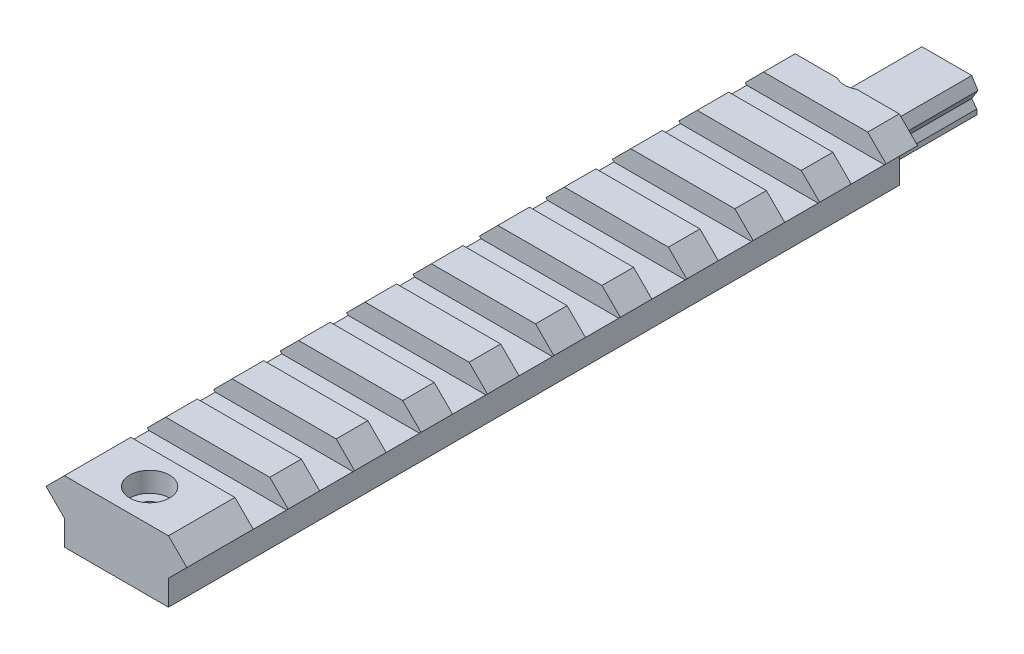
ISO-10303-21;
HEADER;
FILE_DESCRIPTION(('STEP AP214'),'2;1');
FILE_NAME('part.step','',(''),(''),'','','');
FILE_SCHEMA(('AUTOMOTIVE_DESIGN { 1 0 10303 214 1 1 1 1 }'));
ENDSEC;
DATA;
#1=APPLICATION_CONTEXT('core data for automotive mechanical design processes');
#2=APPLICATION_PROTOCOL_DEFINITION('international standard','automotive_design',2000,#1);
#3=PRODUCT_CONTEXT('',#1,'mechanical');
#4=PRODUCT('Part','Part','',(#3));
#5=PRODUCT_RELATED_PRODUCT_CATEGORY('part','',(#4));
#6=PRODUCT_DEFINITION_FORMATION('','',#4);
#7=PRODUCT_DEFINITION_CONTEXT('part definition',#1,'design');
#8=PRODUCT_DEFINITION('design','',#6,#7);
#9=PRODUCT_DEFINITION_SHAPE('','',#8);
#10=(LENGTH_UNIT() NAMED_UNIT(*) SI_UNIT(.MILLI.,.METRE.));
#11=(NAMED_UNIT(*) PLANE_ANGLE_UNIT() SI_UNIT($,.RADIAN.));
#12=(NAMED_UNIT(*) SI_UNIT($,.STERADIAN.) SOLID_ANGLE_UNIT());
#13=UNCERTAINTY_MEASURE_WITH_UNIT(LENGTH_MEASURE(1.E-05),#10,'distance_accuracy_value','');
#14=(GEOMETRIC_REPRESENTATION_CONTEXT(3) GLOBAL_UNCERTAINTY_ASSIGNED_CONTEXT((#13)) GLOBAL_UNIT_ASSIGNED_CONTEXT((#10,
#11,#12)) REPRESENTATION_CONTEXT('',''));
#15=CARTESIAN_POINT('',(0.,0.,0.));
#16=DIRECTION('',(0.,0.,1.));
#17=DIRECTION('',(1.,0.,0.));
#18=AXIS2_PLACEMENT_3D('',#15,#16,#17);
#19=CARTESIAN_POINT('',(0.,0.,0.));
#20=DIRECTION('',(0.,0.,1.));
#21=DIRECTION('',(1.,0.,0.));
#22=AXIS2_PLACEMENT_3D('',#19,#20,#21);
#23=PLANE('',#22);
#24=CARTESIAN_POINT('',(-24.0262438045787,22.5445565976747,0.));
#25=DIRECTION('',(0.,0.,-1.));
#26=DIRECTION('',(-1.,0.,0.));
#27=AXIS2_PLACEMENT_3D('',#24,#25,#26);
#28=CIRCLE('',#27,0.999999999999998);
#29=CARTESIAN_POINT('',(-25.0262438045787,22.5445565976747,0.));
#30=VERTEX_POINT('',#29);
#31=EDGE_CURVE('E556',#30,#30,#28,.T.);
#32=ORIENTED_EDGE('',*,*,#31,.F.);
#33=EDGE_LOOP('',(#32));
#34=FACE_BOUND('',#33,.T.);
#35=DIRECTION('',(0.000438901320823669,-0.999999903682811,0.));
#36=VECTOR('',#35,1.);
#37=CARTESIAN_POINT('',(-19.6456081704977,29.9735706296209,0.));
#38=LINE('',#37,#36);
#39=CARTESIAN_POINT('',(-19.6436124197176,25.4264196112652,0.));
#40=VERTEX_POINT('',#39);
#41=CARTESIAN_POINT('',(-19.6456064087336,29.9695565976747,0.));
#42=VERTEX_POINT('',#41);
#43=EDGE_CURVE('E53',#40,#42,#38,.F.);
#44=ORIENTED_EDGE('',*,*,#43,.F.);
#45=DIRECTION('',(0.999999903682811,0.000438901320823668,0.));
#46=VECTOR('',#45,1.);
#47=CARTESIAN_POINT('',(-21.9412438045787,25.4254111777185,0.));
#48=LINE('',#47,#46);
#49=CARTESIAN_POINT('',(-21.9412438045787,25.4254111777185,0.));
#50=VERTEX_POINT('',#49);
#51=EDGE_CURVE('E551',#50,#40,#48,.T.);
#52=ORIENTED_EDGE('',*,*,#51,.F.);
#53=DIRECTION('',(0.529746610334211,0.848155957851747,0.));
#54=VECTOR('',#53,1.);
#55=CARTESIAN_POINT('',(-22.8782241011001,23.925249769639,0.));
#56=LINE('',#55,#54);
#57=CARTESIAN_POINT('',(-22.8782241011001,23.925249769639,0.));
#58=VERTEX_POINT('',#57);
#59=EDGE_CURVE('E569',#58,#50,#56,.T.);
#60=ORIENTED_EDGE('',*,*,#59,.F.);
#61=DIRECTION('',(-0.529667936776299,0.84820509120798,0.));
#62=VECTOR('',#61,1.);
#63=CARTESIAN_POINT('',(-21.9415380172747,22.4252497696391,0.));
#64=LINE('',#63,#62);
#65=CARTESIAN_POINT('',(-21.9415380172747,22.4252497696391,0.));
#66=VERTEX_POINT('',#65);
#67=EDGE_CURVE('E1209',#66,#58,#64,.T.);
#68=ORIENTED_EDGE('',*,*,#67,.F.);
#69=DIRECTION('',(0.599784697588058,0.80016143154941,0.));
#70=VECTOR('',#69,1.);
#71=CARTESIAN_POINT('',(-22.6912437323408,21.4250815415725,0.));
#72=LINE('',#71,#70);
#73=CARTESIAN_POINT('',(-22.6912437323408,21.4250815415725,0.));
#74=VERTEX_POINT('',#73);
#75=EDGE_CURVE('E1207',#74,#66,#72,.T.);
#76=ORIENTED_EDGE('',*,*,#75,.F.);
#77=DIRECTION('',(0.,1.,0.));
#78=VECTOR('',#77,1.);
#79=CARTESIAN_POINT('',(-22.6912437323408,20.6475815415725,0.));
#80=LINE('',#79,#78);
#81=CARTESIAN_POINT('',(-22.6912437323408,20.6495565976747,0.));
#82=VERTEX_POINT('',#81);
#83=EDGE_CURVE('E11',#82,#74,#80,.T.);
#84=ORIENTED_EDGE('',*,*,#83,.F.);
#85=DIRECTION('',(1.,0.,0.));
#86=VECTOR('',#85,1.);
#87=CARTESIAN_POINT('',(0.,20.6495565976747,0.));
#88=LINE('',#87,#86);
#89=CARTESIAN_POINT('',(-26.0262438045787,20.6495565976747,0.));
#90=VERTEX_POINT('',#89);
#91=EDGE_CURVE('E943',#90,#82,#88,.T.);
#92=ORIENTED_EDGE('',*,*,#91,.F.);
#93=DIRECTION('',(0.,1.,0.));
#94=VECTOR('',#93,1.);
#95=CARTESIAN_POINT('',(-26.0262438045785,-2.13146651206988E-13,0.));
#96=LINE('',#95,#94);
#97=CARTESIAN_POINT('',(-26.0262438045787,24.4395565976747,0.));
#98=VERTEX_POINT('',#97);
#99=EDGE_CURVE('E939',#90,#98,#96,.T.);
#100=ORIENTED_EDGE('',*,*,#99,.T.);
#101=DIRECTION('',(0.707106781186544,-0.707106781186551,0.));
#102=VECTOR('',#101,1.);
#103=CARTESIAN_POINT('',(-0.793343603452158,-0.793343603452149,0.));
#104=LINE('',#103,#102);
#105=CARTESIAN_POINT('',(-28.7912438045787,27.2045565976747,0.));
#106=VERTEX_POINT('',#105);
#107=EDGE_CURVE('E936',#106,#98,#104,.T.);
#108=ORIENTED_EDGE('',*,*,#107,.F.);
#109=DIRECTION('',(-0.707106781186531,-0.707106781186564,0.));
#110=VECTOR('',#109,1.);
#111=CARTESIAN_POINT('',(-27.9979002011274,27.9979002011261,0.));
#112=LINE('',#111,#110);
#113=CARTESIAN_POINT('',(-26.0262438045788,29.9695565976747,0.));
#114=VERTEX_POINT('',#113);
#115=EDGE_CURVE('E911',#114,#106,#112,.T.);
#116=ORIENTED_EDGE('',*,*,#115,.F.);
#117=DIRECTION('',(1.,0.,0.));
#118=VECTOR('',#117,1.);
#119=CARTESIAN_POINT('',(0.,29.9695565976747,0.));
#120=LINE('',#119,#118);
#121=EDGE_CURVE('E555',#114,#42,#120,.T.);
#122=ORIENTED_EDGE('',*,*,#121,.T.);
#123=EDGE_LOOP('',(#44,#52,#60,#68,#76,#84,#92,#100,#108,#116,#122));
#124=FACE_BOUND('',#123,.T.);
#125=ADVANCED_FACE('F36',(#34,#124),#23,.F.);
#126=CARTESIAN_POINT('',(-12.3562438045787,22.5445565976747,0.));
#127=DIRECTION('',(0.,0.,-1.));
#128=DIRECTION('',(-1.,0.,0.));
#129=AXIS2_PLACEMENT_3D('',#126,#127,#128);
#130=CIRCLE('',#129,1.);
#131=CARTESIAN_POINT('',(-13.3562438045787,22.5445565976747,0.));
#132=VERTEX_POINT('',#131);
#133=EDGE_CURVE('E1178',#132,#132,#130,.T.);
#134=ORIENTED_EDGE('',*,*,#133,.F.);
#135=EDGE_LOOP('',(#134));
#136=FACE_BOUND('',#135,.T.);
#137=DIRECTION('',(0.000438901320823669,-0.999999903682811,0.));
#138=VECTOR('',#137,1.);
#139=CARTESIAN_POINT('',(-16.7408709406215,29.9748455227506,0.));
#140=LINE('',#139,#138);
#141=CARTESIAN_POINT('',(-16.7408686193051,29.9695565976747,0.));
#142=VERTEX_POINT('',#141);
#143=CARTESIAN_POINT('',(-16.7388751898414,25.4276945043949,0.));
#144=VERTEX_POINT('',#143);
#145=EDGE_CURVE('E542',#142,#144,#140,.T.);
#146=ORIENTED_EDGE('',*,*,#145,.F.);
#147=CARTESIAN_POINT('',(-10.3562438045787,29.9695565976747,0.));
#148=VERTEX_POINT('',#147);
#149=EDGE_CURVE('E956',#142,#148,#120,.T.);
#150=ORIENTED_EDGE('',*,*,#149,.T.);
#151=DIRECTION('',(0.707106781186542,-0.707106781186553,0.));
#152=VECTOR('',#151,1.);
#153=CARTESIAN_POINT('',(9.80665639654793,9.80665639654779,0.));
#154=LINE('',#153,#152);
#155=CARTESIAN_POINT('',(-7.59124380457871,27.2045565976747,0.));
#156=VERTEX_POINT('',#155);
#157=EDGE_CURVE('E953',#148,#156,#154,.T.);
#158=ORIENTED_EDGE('',*,*,#157,.T.);
#159=DIRECTION('',(-0.707106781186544,-0.707106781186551,0.));
#160=VECTOR('',#159,1.);
#161=CARTESIAN_POINT('',(-17.3979002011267,17.3979002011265,0.));
#162=LINE('',#161,#160);
#163=CARTESIAN_POINT('',(-10.3562438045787,24.4395565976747,0.));
#164=VERTEX_POINT('',#163);
#165=EDGE_CURVE('E950',#156,#164,#162,.T.);
#166=ORIENTED_EDGE('',*,*,#165,.T.);
#167=DIRECTION('',(0.,1.,0.));
#168=VECTOR('',#167,1.);
#169=CARTESIAN_POINT('',(-10.3562438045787,0.,0.));
#170=LINE('',#169,#168);
#171=CARTESIAN_POINT('',(-10.3562438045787,20.6495565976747,0.));
#172=VERTEX_POINT('',#171);
#173=EDGE_CURVE('E946',#172,#164,#170,.T.);
#174=ORIENTED_EDGE('',*,*,#173,.F.);
#175=CARTESIAN_POINT('',(-18.1912438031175,20.649556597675,0.));
#176=VERTEX_POINT('',#175);
#177=EDGE_CURVE('E942',#176,#172,#88,.T.);
#178=ORIENTED_EDGE('',*,*,#177,.F.);
#179=DIRECTION('',(-0.999999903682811,-0.000438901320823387,0.));
#180=VECTOR('',#179,1.);
#181=CARTESIAN_POINT('',(-13.6912438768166,20.651531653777,0.));
#182=LINE('',#181,#180);
#183=CARTESIAN_POINT('',(-13.6912438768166,20.651531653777,0.));
#184=VERTEX_POINT('',#183);
#185=EDGE_CURVE('E61',#184,#176,#182,.T.);
#186=ORIENTED_EDGE('',*,*,#185,.F.);
#187=DIRECTION('',(0.00043890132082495,-0.999999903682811,0.));
#188=VECTOR('',#187,1.);
#189=CARTESIAN_POINT('',(-13.6915851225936,21.4290315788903,0.));
#190=LINE('',#189,#188);
#191=CARTESIAN_POINT('',(-13.6915851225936,21.4290315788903,0.));
#192=VERTEX_POINT('',#191);
#193=EDGE_CURVE('E578',#192,#184,#190,.T.);
#194=ORIENTED_EDGE('',*,*,#193,.F.);
#195=DIRECTION('',(0.601095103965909,-0.799177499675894,0.));
#196=VECTOR('',#195,1.);
#197=CARTESIAN_POINT('',(-14.4415380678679,22.42612091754,0.));
#198=LINE('',#197,#196);
#199=CARTESIAN_POINT('',(-14.4415380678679,22.42612091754,0.));
#200=VERTEX_POINT('',#199);
#201=EDGE_CURVE('E575',#200,#192,#198,.T.);
#202=ORIENTED_EDGE('',*,*,#201,.F.);
#203=DIRECTION('',(-0.529295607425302,-0.848437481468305,0.));
#204=VECTOR('',#203,1.);
#205=CARTESIAN_POINT('',(-13.503899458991,23.9291141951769,0.));
#206=LINE('',#205,#204);
#207=CARTESIAN_POINT('',(-13.503899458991,23.9291141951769,0.));
#208=VERTEX_POINT('',#207);
#209=EDGE_CURVE('E567',#208,#200,#206,.T.);
#210=ORIENTED_EDGE('',*,*,#209,.F.);
#211=DIRECTION('',(0.530040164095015,-0.847972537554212,0.));
#212=VECTOR('',#211,1.);
#213=CARTESIAN_POINT('',(-14.4412438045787,25.4287029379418,0.));
#214=LINE('',#213,#212);
#215=CARTESIAN_POINT('',(-14.4412438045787,25.4287029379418,0.));
#216=VERTEX_POINT('',#215);
#217=EDGE_CURVE('E563',#216,#208,#214,.T.);
#218=ORIENTED_EDGE('',*,*,#217,.F.);
#219=EDGE_CURVE('E564',#144,#216,#48,.T.);
#220=ORIENTED_EDGE('',*,*,#219,.F.);
#221=EDGE_LOOP('',(#146,#150,#158,#166,#174,#178,#186,#194,#202,#210,#218,#220));
#222=FACE_BOUND('',#221,.T.);
#223=ADVANCED_FACE('F1168',(#136,#222),#23,.F.);
#224=CARTESIAN_POINT('',(-27.9979002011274,27.9979002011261,110.));
#225=DIRECTION('',(0.707106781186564,-0.707106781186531,0.));
#226=DIRECTION('',(0.707106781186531,0.707106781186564,0.));
#227=AXIS2_PLACEMENT_3D('',#224,#225,#226);
#228=PLANE('',#227);
#229=DIRECTION('',(0.,0.,-1.));
#230=VECTOR('',#229,1.);
#231=CARTESIAN_POINT('',(-28.7912438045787,27.2045565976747,110.));
#232=LINE('',#231,#230);
#233=CARTESIAN_POINT('',(-28.7912438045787,27.2045565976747,4.75));
#234=VERTEX_POINT('',#233);
#235=EDGE_CURVE('E981',#234,#106,#232,.T.);
#236=ORIENTED_EDGE('',*,*,#235,.F.);
#237=DIRECTION('',(0.707106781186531,0.707106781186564,0.));
#238=VECTOR('',#237,1.);
#239=CARTESIAN_POINT('',(-27.9979002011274,27.9979002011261,4.75));
#240=LINE('',#239,#238);
#241=CARTESIAN_POINT('',(-26.0262438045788,29.9695565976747,4.75));
#242=VERTEX_POINT('',#241);
#243=EDGE_CURVE('E879',#234,#242,#240,.T.);
#244=ORIENTED_EDGE('',*,*,#243,.T.);
#245=DIRECTION('',(0.,0.,-1.));
#246=VECTOR('',#245,1.);
#247=CARTESIAN_POINT('',(-26.0262438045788,29.9695565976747,110.));
#248=LINE('',#247,#246);
#249=EDGE_CURVE('E933',#242,#114,#248,.T.);
#250=ORIENTED_EDGE('',*,*,#249,.T.);
#251=ORIENTED_EDGE('',*,*,#115,.T.);
#252=EDGE_LOOP('',(#236,#244,#250,#251));
#253=FACE_BOUND('',#252,.T.);
#254=ADVANCED_FACE('F1066',(#253),#228,.F.);
#255=CARTESIAN_POINT('',(-26.0262438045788,29.9695565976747,14.75));
#256=VERTEX_POINT('',#255);
#257=CARTESIAN_POINT('',(-26.0262438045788,29.9695565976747,9.99999999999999));
#258=VERTEX_POINT('',#257);
#259=EDGE_CURVE('E1340',#256,#258,#248,.T.);
#260=ORIENTED_EDGE('',*,*,#259,.T.);
#261=DIRECTION('',(-0.707106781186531,-0.707106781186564,0.));
#262=VECTOR('',#261,1.);
#263=CARTESIAN_POINT('',(-27.9979002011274,27.9979002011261,9.99999999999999));
#264=LINE('',#263,#262);
#265=CARTESIAN_POINT('',(-28.7912438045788,27.2045565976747,10.));
#266=VERTEX_POINT('',#265);
#267=EDGE_CURVE('E869',#258,#266,#264,.T.);
#268=ORIENTED_EDGE('',*,*,#267,.T.);
#269=CARTESIAN_POINT('',(-28.7912438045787,27.2045565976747,14.75));
#270=VERTEX_POINT('',#269);
#271=EDGE_CURVE('E1068',#270,#266,#232,.T.);
#272=ORIENTED_EDGE('',*,*,#271,.F.);
#273=DIRECTION('',(0.707106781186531,0.707106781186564,0.));
#274=VECTOR('',#273,1.);
#275=CARTESIAN_POINT('',(-27.9979002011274,27.9979002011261,14.75));
#276=LINE('',#275,#274);
#277=EDGE_CURVE('E859',#270,#256,#276,.T.);
#278=ORIENTED_EDGE('',*,*,#277,.T.);
#279=EDGE_LOOP('',(#260,#268,#272,#278));
#280=FACE_BOUND('',#279,.T.);
#281=ADVANCED_FACE('F1346',(#280),#228,.F.);
#282=CARTESIAN_POINT('',(-26.0262438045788,29.9695565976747,24.75));
#283=VERTEX_POINT('',#282);
#284=CARTESIAN_POINT('',(-26.0262438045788,29.9695565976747,20.));
#285=VERTEX_POINT('',#284);
#286=EDGE_CURVE('E1338',#283,#285,#248,.T.);
#287=ORIENTED_EDGE('',*,*,#286,.T.);
#288=DIRECTION('',(-0.707106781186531,-0.707106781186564,0.));
#289=VECTOR('',#288,1.);
#290=CARTESIAN_POINT('',(-27.9979002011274,27.9979002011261,20.));
#291=LINE('',#290,#289);
#292=CARTESIAN_POINT('',(-28.7912438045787,27.2045565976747,20.));
#293=VERTEX_POINT('',#292);
#294=EDGE_CURVE('E849',#285,#293,#291,.T.);
#295=ORIENTED_EDGE('',*,*,#294,.T.);
#296=CARTESIAN_POINT('',(-28.7912438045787,27.2045565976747,24.75));
#297=VERTEX_POINT('',#296);
#298=EDGE_CURVE('E1070',#297,#293,#232,.T.);
#299=ORIENTED_EDGE('',*,*,#298,.F.);
#300=DIRECTION('',(0.707106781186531,0.707106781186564,0.));
#301=VECTOR('',#300,1.);
#302=CARTESIAN_POINT('',(-27.9979002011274,27.9979002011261,24.75));
#303=LINE('',#302,#301);
#304=EDGE_CURVE('E839',#297,#283,#303,.T.);
#305=ORIENTED_EDGE('',*,*,#304,.T.);
#306=EDGE_LOOP('',(#287,#295,#299,#305));
#307=FACE_BOUND('',#306,.T.);
#308=ADVANCED_FACE('F1336',(#307),#228,.F.);
#309=CARTESIAN_POINT('',(-26.0262438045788,29.9695565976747,34.75));
#310=VERTEX_POINT('',#309);
#311=CARTESIAN_POINT('',(-26.0262438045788,29.9695565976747,30.));
#312=VERTEX_POINT('',#311);
#313=EDGE_CURVE('E1339',#310,#312,#248,.T.);
#314=ORIENTED_EDGE('',*,*,#313,.T.);
#315=DIRECTION('',(-0.707106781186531,-0.707106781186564,0.));
#316=VECTOR('',#315,1.);
#317=CARTESIAN_POINT('',(-27.9979002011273,27.9979002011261,30.));
#318=LINE('',#317,#316);
#319=CARTESIAN_POINT('',(-28.7912438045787,27.2045565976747,30.));
#320=VERTEX_POINT('',#319);
#321=EDGE_CURVE('E829',#312,#320,#318,.T.);
#322=ORIENTED_EDGE('',*,*,#321,.T.);
#323=CARTESIAN_POINT('',(-28.7912438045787,27.2045565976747,34.75));
#324=VERTEX_POINT('',#323);
#325=EDGE_CURVE('E1073',#324,#320,#232,.T.);
#326=ORIENTED_EDGE('',*,*,#325,.F.);
#327=DIRECTION('',(0.707106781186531,0.707106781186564,0.));
#328=VECTOR('',#327,1.);
#329=CARTESIAN_POINT('',(-27.9979002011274,27.9979002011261,34.75));
#330=LINE('',#329,#328);
#331=EDGE_CURVE('E819',#324,#310,#330,.T.);
#332=ORIENTED_EDGE('',*,*,#331,.T.);
#333=EDGE_LOOP('',(#314,#322,#326,#332));
#334=FACE_BOUND('',#333,.T.);
#335=ADVANCED_FACE('F1442',(#334),#228,.F.);
#336=CARTESIAN_POINT('',(-26.0262438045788,29.9695565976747,44.75));
#337=VERTEX_POINT('',#336);
#338=CARTESIAN_POINT('',(-26.0262438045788,29.9695565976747,40.));
#339=VERTEX_POINT('',#338);
#340=EDGE_CURVE('E1342',#337,#339,#248,.T.);
#341=ORIENTED_EDGE('',*,*,#340,.T.);
#342=DIRECTION('',(-0.707106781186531,-0.707106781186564,0.));
#343=VECTOR('',#342,1.);
#344=CARTESIAN_POINT('',(-27.9979002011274,27.9979002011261,40.));
#345=LINE('',#344,#343);
#346=CARTESIAN_POINT('',(-28.7912438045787,27.2045565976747,40.));
#347=VERTEX_POINT('',#346);
#348=EDGE_CURVE('E809',#339,#347,#345,.T.);
#349=ORIENTED_EDGE('',*,*,#348,.T.);
#350=CARTESIAN_POINT('',(-28.7912438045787,27.2045565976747,44.75));
#351=VERTEX_POINT('',#350);
#352=EDGE_CURVE('E1076',#351,#347,#232,.T.);
#353=ORIENTED_EDGE('',*,*,#352,.F.);
#354=DIRECTION('',(0.707106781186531,0.707106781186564,0.));
#355=VECTOR('',#354,1.);
#356=CARTESIAN_POINT('',(-27.9979002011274,27.9979002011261,44.75));
#357=LINE('',#356,#355);
#358=EDGE_CURVE('E799',#351,#337,#357,.T.);
#359=ORIENTED_EDGE('',*,*,#358,.T.);
#360=EDGE_LOOP('',(#341,#349,#353,#359));
#361=FACE_BOUND('',#360,.T.);
#362=ADVANCED_FACE('F1425',(#361),#228,.F.);
#363=CARTESIAN_POINT('',(-26.0262438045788,29.9695565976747,54.75));
#364=VERTEX_POINT('',#363);
#365=CARTESIAN_POINT('',(-26.0262438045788,29.9695565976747,50.));
#366=VERTEX_POINT('',#365);
#367=EDGE_CURVE('E1416',#364,#366,#248,.T.);
#368=ORIENTED_EDGE('',*,*,#367,.T.);
#369=DIRECTION('',(-0.707106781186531,-0.707106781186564,0.));
#370=VECTOR('',#369,1.);
#371=CARTESIAN_POINT('',(-27.9979002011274,27.9979002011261,50.));
#372=LINE('',#371,#370);
#373=CARTESIAN_POINT('',(-28.7912438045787,27.2045565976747,50.));
#374=VERTEX_POINT('',#373);
#375=EDGE_CURVE('E789',#366,#374,#372,.T.);
#376=ORIENTED_EDGE('',*,*,#375,.T.);
#377=CARTESIAN_POINT('',(-28.7912438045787,27.2045565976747,54.75));
#378=VERTEX_POINT('',#377);
#379=EDGE_CURVE('E1079',#378,#374,#232,.T.);
#380=ORIENTED_EDGE('',*,*,#379,.F.);
#381=DIRECTION('',(0.707106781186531,0.707106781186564,0.));
#382=VECTOR('',#381,1.);
#383=CARTESIAN_POINT('',(-27.9979002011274,27.9979002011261,54.75));
#384=LINE('',#383,#382);
#385=EDGE_CURVE('E779',#378,#364,#384,.T.);
#386=ORIENTED_EDGE('',*,*,#385,.T.);
#387=EDGE_LOOP('',(#368,#376,#380,#386));
#388=FACE_BOUND('',#387,.T.);
#389=ADVANCED_FACE('F1493',(#388),#228,.F.);
#390=CARTESIAN_POINT('',(-26.0262438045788,29.9695565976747,64.75));
#391=VERTEX_POINT('',#390);
#392=CARTESIAN_POINT('',(-26.0262438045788,29.9695565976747,60.));
#393=VERTEX_POINT('',#392);
#394=EDGE_CURVE('E1413',#391,#393,#248,.T.);
#395=ORIENTED_EDGE('',*,*,#394,.T.);
#396=DIRECTION('',(-0.707106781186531,-0.707106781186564,0.));
#397=VECTOR('',#396,1.);
#398=CARTESIAN_POINT('',(-27.9979002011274,27.9979002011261,60.));
#399=LINE('',#398,#397);
#400=CARTESIAN_POINT('',(-28.7912438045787,27.2045565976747,60.));
#401=VERTEX_POINT('',#400);
#402=EDGE_CURVE('E769',#393,#401,#399,.T.);
#403=ORIENTED_EDGE('',*,*,#402,.T.);
#404=CARTESIAN_POINT('',(-28.7912438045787,27.2045565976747,64.75));
#405=VERTEX_POINT('',#404);
#406=EDGE_CURVE('E1082',#405,#401,#232,.T.);
#407=ORIENTED_EDGE('',*,*,#406,.F.);
#408=DIRECTION('',(0.707106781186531,0.707106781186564,0.));
#409=VECTOR('',#408,1.);
#410=CARTESIAN_POINT('',(-27.9979002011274,27.9979002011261,64.75));
#411=LINE('',#410,#409);
#412=EDGE_CURVE('E759',#405,#391,#411,.T.);
#413=ORIENTED_EDGE('',*,*,#412,.T.);
#414=EDGE_LOOP('',(#395,#403,#407,#413));
#415=FACE_BOUND('',#414,.T.);
#416=ADVANCED_FACE('F1406',(#415),#228,.F.);
#417=CARTESIAN_POINT('',(-26.0262438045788,29.9695565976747,74.75));
#418=VERTEX_POINT('',#417);
#419=CARTESIAN_POINT('',(-26.0262438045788,29.9695565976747,70.));
#420=VERTEX_POINT('',#419);
#421=EDGE_CURVE('E1411',#418,#420,#248,.T.);
#422=ORIENTED_EDGE('',*,*,#421,.T.);
#423=DIRECTION('',(-0.707106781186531,-0.707106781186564,0.));
#424=VECTOR('',#423,1.);
#425=CARTESIAN_POINT('',(-27.9979002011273,27.9979002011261,70.));
#426=LINE('',#425,#424);
#427=CARTESIAN_POINT('',(-28.7912438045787,27.2045565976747,70.));
#428=VERTEX_POINT('',#427);
#429=EDGE_CURVE('E749',#420,#428,#426,.T.);
#430=ORIENTED_EDGE('',*,*,#429,.T.);
#431=CARTESIAN_POINT('',(-28.7912438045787,27.2045565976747,74.75));
#432=VERTEX_POINT('',#431);
#433=EDGE_CURVE('E1085',#432,#428,#232,.T.);
#434=ORIENTED_EDGE('',*,*,#433,.F.);
#435=DIRECTION('',(0.707106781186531,0.707106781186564,0.));
#436=VECTOR('',#435,1.);
#437=CARTESIAN_POINT('',(-27.9979002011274,27.9979002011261,74.75));
#438=LINE('',#437,#436);
#439=EDGE_CURVE('E739',#432,#418,#438,.T.);
#440=ORIENTED_EDGE('',*,*,#439,.T.);
#441=EDGE_LOOP('',(#422,#430,#434,#440));
#442=FACE_BOUND('',#441,.T.);
#443=ADVANCED_FACE('F1401',(#442),#228,.F.);
#444=CARTESIAN_POINT('',(-26.0262438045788,29.9695565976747,84.75));
#445=VERTEX_POINT('',#444);
#446=CARTESIAN_POINT('',(-26.0262438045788,29.9695565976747,80.));
#447=VERTEX_POINT('',#446);
#448=EDGE_CURVE('E1410',#445,#447,#248,.T.);
#449=ORIENTED_EDGE('',*,*,#448,.T.);
#450=DIRECTION('',(-0.707106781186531,-0.707106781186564,0.));
#451=VECTOR('',#450,1.);
#452=CARTESIAN_POINT('',(-27.9979002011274,27.9979002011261,79.9999999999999));
#453=LINE('',#452,#451);
#454=CARTESIAN_POINT('',(-28.7912438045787,27.2045565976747,79.9999999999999));
#455=VERTEX_POINT('',#454);
#456=EDGE_CURVE('E729',#447,#455,#453,.T.);
#457=ORIENTED_EDGE('',*,*,#456,.T.);
#458=CARTESIAN_POINT('',(-28.7912438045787,27.2045565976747,84.75));
#459=VERTEX_POINT('',#458);
#460=EDGE_CURVE('E1088',#459,#455,#232,.T.);
#461=ORIENTED_EDGE('',*,*,#460,.F.);
#462=DIRECTION('',(0.707106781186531,0.707106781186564,0.));
#463=VECTOR('',#462,1.);
#464=CARTESIAN_POINT('',(-27.9979002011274,27.9979002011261,84.75));
#465=LINE('',#464,#463);
#466=EDGE_CURVE('E719',#459,#445,#465,.T.);
#467=ORIENTED_EDGE('',*,*,#466,.T.);
#468=EDGE_LOOP('',(#449,#457,#461,#467));
#469=FACE_BOUND('',#468,.T.);
#470=ADVANCED_FACE('F1396',(#469),#228,.F.);
#471=CARTESIAN_POINT('',(-26.0262438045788,29.9695565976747,94.7499999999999));
#472=VERTEX_POINT('',#471);
#473=CARTESIAN_POINT('',(-26.0262438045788,29.9695565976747,90.));
#474=VERTEX_POINT('',#473);
#475=EDGE_CURVE('E962',#472,#474,#248,.T.);
#476=ORIENTED_EDGE('',*,*,#475,.T.);
#477=DIRECTION('',(-0.707106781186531,-0.707106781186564,0.));
#478=VECTOR('',#477,1.);
#479=CARTESIAN_POINT('',(-27.9979002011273,27.9979002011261,89.9999999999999));
#480=LINE('',#479,#478);
#481=CARTESIAN_POINT('',(-28.7912438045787,27.2045565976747,89.9999999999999));
#482=VERTEX_POINT('',#481);
#483=EDGE_CURVE('E709',#474,#482,#480,.T.);
#484=ORIENTED_EDGE('',*,*,#483,.T.);
#485=CARTESIAN_POINT('',(-28.7912438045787,27.2045565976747,94.7499999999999));
#486=VERTEX_POINT('',#485);
#487=EDGE_CURVE('E986',#486,#482,#232,.T.);
#488=ORIENTED_EDGE('',*,*,#487,.F.);
#489=DIRECTION('',(0.707106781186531,0.707106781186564,0.));
#490=VECTOR('',#489,1.);
#491=CARTESIAN_POINT('',(-27.9979002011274,27.9979002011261,94.7499999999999));
#492=LINE('',#491,#490);
#493=EDGE_CURVE('E699',#486,#472,#492,.T.);
#494=ORIENTED_EDGE('',*,*,#493,.T.);
#495=EDGE_LOOP('',(#476,#484,#488,#494));
#496=FACE_BOUND('',#495,.T.);
#497=ADVANCED_FACE('F1096',(#496),#228,.F.);
#498=CARTESIAN_POINT('',(9.80665639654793,9.80665639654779,110.));
#499=DIRECTION('',(0.707106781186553,0.707106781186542,0.));
#500=DIRECTION('',(-0.707106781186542,0.707106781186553,0.));
#501=AXIS2_PLACEMENT_3D('',#498,#499,#500);
#502=PLANE('',#501);
#503=DIRECTION('',(-0.707106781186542,0.707106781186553,0.));
#504=VECTOR('',#503,1.);
#505=CARTESIAN_POINT('',(9.80665639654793,9.80665639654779,4.75));
#506=LINE('',#505,#504);
#507=CARTESIAN_POINT('',(-7.59124380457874,27.2045565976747,4.75));
#508=VERTEX_POINT('',#507);
#509=CARTESIAN_POINT('',(-10.3562438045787,29.9695565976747,4.75));
#510=VERTEX_POINT('',#509);
#511=EDGE_CURVE('E872',#508,#510,#506,.T.);
#512=ORIENTED_EDGE('',*,*,#511,.F.);
#513=DIRECTION('',(0.,0.,-1.));
#514=VECTOR('',#513,1.);
#515=CARTESIAN_POINT('',(-7.59124380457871,27.2045565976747,110.));
#516=LINE('',#515,#514);
#517=EDGE_CURVE('E966',#508,#156,#516,.T.);
#518=ORIENTED_EDGE('',*,*,#517,.T.);
#519=ORIENTED_EDGE('',*,*,#157,.F.);
#520=DIRECTION('',(0.,0.,-1.));
#521=VECTOR('',#520,1.);
#522=CARTESIAN_POINT('',(-10.3562438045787,29.9695565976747,110.));
#523=LINE('',#522,#521);
#524=EDGE_CURVE('E961',#510,#148,#523,.T.);
#525=ORIENTED_EDGE('',*,*,#524,.F.);
#526=EDGE_LOOP('',(#512,#518,#519,#525));
#527=FACE_BOUND('',#526,.T.);
#528=ADVANCED_FACE('F1166',(#527),#502,.T.);
#529=DIRECTION('',(0.707106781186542,-0.707106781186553,0.));
#530=VECTOR('',#529,1.);
#531=CARTESIAN_POINT('',(9.80665639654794,9.80665639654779,9.99999999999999));
#532=LINE('',#531,#530);
#533=CARTESIAN_POINT('',(-10.3562438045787,29.9695565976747,10.));
#534=VERTEX_POINT('',#533);
#535=CARTESIAN_POINT('',(-7.59124380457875,27.2045565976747,10.));
#536=VERTEX_POINT('',#535);
#537=EDGE_CURVE('E862',#534,#536,#532,.T.);
#538=ORIENTED_EDGE('',*,*,#537,.F.);
#539=CARTESIAN_POINT('',(-10.3562438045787,29.9695565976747,14.75));
#540=VERTEX_POINT('',#539);
#541=EDGE_CURVE('E1148',#540,#534,#523,.T.);
#542=ORIENTED_EDGE('',*,*,#541,.F.);
#543=DIRECTION('',(-0.707106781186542,0.707106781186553,0.));
#544=VECTOR('',#543,1.);
#545=CARTESIAN_POINT('',(9.80665639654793,9.80665639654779,14.75));
#546=LINE('',#545,#544);
#547=CARTESIAN_POINT('',(-7.59124380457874,27.2045565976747,14.75));
#548=VERTEX_POINT('',#547);
#549=EDGE_CURVE('E852',#548,#540,#546,.T.);
#550=ORIENTED_EDGE('',*,*,#549,.F.);
#551=EDGE_CURVE('E1317',#548,#536,#516,.T.);
#552=ORIENTED_EDGE('',*,*,#551,.T.);
#553=EDGE_LOOP('',(#538,#542,#550,#552));
#554=FACE_BOUND('',#553,.T.);
#555=ADVANCED_FACE('F1325',(#554),#502,.T.);
#556=DIRECTION('',(0.707106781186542,-0.707106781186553,0.));
#557=VECTOR('',#556,1.);
#558=CARTESIAN_POINT('',(9.80665639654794,9.80665639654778,20.));
#559=LINE('',#558,#557);
#560=CARTESIAN_POINT('',(-10.3562438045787,29.9695565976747,20.));
#561=VERTEX_POINT('',#560);
#562=CARTESIAN_POINT('',(-7.59124380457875,27.2045565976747,20.));
#563=VERTEX_POINT('',#562);
#564=EDGE_CURVE('E842',#561,#563,#559,.T.);
#565=ORIENTED_EDGE('',*,*,#564,.F.);
#566=CARTESIAN_POINT('',(-10.3562438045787,29.9695565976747,24.75));
#567=VERTEX_POINT('',#566);
#568=EDGE_CURVE('E1142',#567,#561,#523,.T.);
#569=ORIENTED_EDGE('',*,*,#568,.F.);
#570=DIRECTION('',(-0.707106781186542,0.707106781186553,0.));
#571=VECTOR('',#570,1.);
#572=CARTESIAN_POINT('',(9.80665639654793,9.80665639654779,24.75));
#573=LINE('',#572,#571);
#574=CARTESIAN_POINT('',(-7.59124380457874,27.2045565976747,24.75));
#575=VERTEX_POINT('',#574);
#576=EDGE_CURVE('E832',#575,#567,#573,.T.);
#577=ORIENTED_EDGE('',*,*,#576,.F.);
#578=EDGE_CURVE('E1311',#575,#563,#516,.T.);
#579=ORIENTED_EDGE('',*,*,#578,.T.);
#580=EDGE_LOOP('',(#565,#569,#577,#579));
#581=FACE_BOUND('',#580,.T.);
#582=ADVANCED_FACE('F1458',(#581),#502,.T.);
#583=DIRECTION('',(0.707106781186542,-0.707106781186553,0.));
#584=VECTOR('',#583,1.);
#585=CARTESIAN_POINT('',(9.80665639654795,9.80665639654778,30.));
#586=LINE('',#585,#584);
#587=CARTESIAN_POINT('',(-10.3562438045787,29.9695565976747,30.));
#588=VERTEX_POINT('',#587);
#589=CARTESIAN_POINT('',(-7.59124380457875,27.2045565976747,30.));
#590=VERTEX_POINT('',#589);
#591=EDGE_CURVE('E822',#588,#590,#586,.T.);
#592=ORIENTED_EDGE('',*,*,#591,.F.);
#593=CARTESIAN_POINT('',(-10.3562438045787,29.9695565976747,34.75));
#594=VERTEX_POINT('',#593);
#595=EDGE_CURVE('E1136',#594,#588,#523,.T.);
#596=ORIENTED_EDGE('',*,*,#595,.F.);
#597=DIRECTION('',(-0.707106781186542,0.707106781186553,0.));
#598=VECTOR('',#597,1.);
#599=CARTESIAN_POINT('',(9.80665639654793,9.80665639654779,34.75));
#600=LINE('',#599,#598);
#601=CARTESIAN_POINT('',(-7.59124380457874,27.2045565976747,34.75));
#602=VERTEX_POINT('',#601);
#603=EDGE_CURVE('E812',#602,#594,#600,.T.);
#604=ORIENTED_EDGE('',*,*,#603,.F.);
#605=EDGE_CURVE('E1305',#602,#590,#516,.T.);
#606=ORIENTED_EDGE('',*,*,#605,.T.);
#607=EDGE_LOOP('',(#592,#596,#604,#606));
#608=FACE_BOUND('',#607,.T.);
#609=ADVANCED_FACE('F1448',(#608),#502,.T.);
#610=DIRECTION('',(0.707106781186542,-0.707106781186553,0.));
#611=VECTOR('',#610,1.);
#612=CARTESIAN_POINT('',(9.80665639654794,9.80665639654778,40.));
#613=LINE('',#612,#611);
#614=CARTESIAN_POINT('',(-10.3562438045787,29.9695565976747,40.));
#615=VERTEX_POINT('',#614);
#616=CARTESIAN_POINT('',(-7.59124380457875,27.2045565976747,40.));
#617=VERTEX_POINT('',#616);
#618=EDGE_CURVE('E802',#615,#617,#613,.T.);
#619=ORIENTED_EDGE('',*,*,#618,.F.);
#620=CARTESIAN_POINT('',(-10.3562438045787,29.9695565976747,44.75));
#621=VERTEX_POINT('',#620);
#622=EDGE_CURVE('E1130',#621,#615,#523,.T.);
#623=ORIENTED_EDGE('',*,*,#622,.F.);
#624=DIRECTION('',(-0.707106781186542,0.707106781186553,0.));
#625=VECTOR('',#624,1.);
#626=CARTESIAN_POINT('',(9.80665639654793,9.80665639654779,44.75));
#627=LINE('',#626,#625);
#628=CARTESIAN_POINT('',(-7.59124380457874,27.2045565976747,44.75));
#629=VERTEX_POINT('',#628);
#630=EDGE_CURVE('E792',#629,#621,#627,.T.);
#631=ORIENTED_EDGE('',*,*,#630,.F.);
#632=EDGE_CURVE('E1299',#629,#617,#516,.T.);
#633=ORIENTED_EDGE('',*,*,#632,.T.);
#634=EDGE_LOOP('',(#619,#623,#631,#633));
#635=FACE_BOUND('',#634,.T.);
#636=ADVANCED_FACE('F1430',(#635),#502,.T.);
#637=DIRECTION('',(0.707106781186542,-0.707106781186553,0.));
#638=VECTOR('',#637,1.);
#639=CARTESIAN_POINT('',(9.80665639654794,9.80665639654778,50.));
#640=LINE('',#639,#638);
#641=CARTESIAN_POINT('',(-10.3562438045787,29.9695565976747,50.));
#642=VERTEX_POINT('',#641);
#643=CARTESIAN_POINT('',(-7.59124380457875,27.2045565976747,50.));
#644=VERTEX_POINT('',#643);
#645=EDGE_CURVE('E782',#642,#644,#640,.T.);
#646=ORIENTED_EDGE('',*,*,#645,.F.);
#647=CARTESIAN_POINT('',(-10.3562438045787,29.9695565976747,54.75));
#648=VERTEX_POINT('',#647);
#649=EDGE_CURVE('E1124',#648,#642,#523,.T.);
#650=ORIENTED_EDGE('',*,*,#649,.F.);
#651=DIRECTION('',(-0.707106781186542,0.707106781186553,0.));
#652=VECTOR('',#651,1.);
#653=CARTESIAN_POINT('',(9.80665639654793,9.80665639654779,54.75));
#654=LINE('',#653,#652);
#655=CARTESIAN_POINT('',(-7.59124380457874,27.2045565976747,54.75));
#656=VERTEX_POINT('',#655);
#657=EDGE_CURVE('E772',#656,#648,#654,.T.);
#658=ORIENTED_EDGE('',*,*,#657,.F.);
#659=EDGE_CURVE('E1293',#656,#644,#516,.T.);
#660=ORIENTED_EDGE('',*,*,#659,.T.);
#661=EDGE_LOOP('',(#646,#650,#658,#660));
#662=FACE_BOUND('',#661,.T.);
#663=ADVANCED_FACE('F2117',(#662),#502,.T.);
#664=DIRECTION('',(0.707106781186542,-0.707106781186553,0.));
#665=VECTOR('',#664,1.);
#666=CARTESIAN_POINT('',(9.80665639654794,9.80665639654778,60.));
#667=LINE('',#666,#665);
#668=CARTESIAN_POINT('',(-10.3562438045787,29.9695565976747,60.));
#669=VERTEX_POINT('',#668);
#670=CARTESIAN_POINT('',(-7.59124380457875,27.2045565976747,60.));
#671=VERTEX_POINT('',#670);
#672=EDGE_CURVE('E762',#669,#671,#667,.T.);
#673=ORIENTED_EDGE('',*,*,#672,.F.);
#674=CARTESIAN_POINT('',(-10.3562438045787,29.9695565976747,64.75));
#675=VERTEX_POINT('',#674);
#676=EDGE_CURVE('E1118',#675,#669,#523,.T.);
#677=ORIENTED_EDGE('',*,*,#676,.F.);
#678=DIRECTION('',(-0.707106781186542,0.707106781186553,0.));
#679=VECTOR('',#678,1.);
#680=CARTESIAN_POINT('',(9.80665639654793,9.80665639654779,64.75));
#681=LINE('',#680,#679);
#682=CARTESIAN_POINT('',(-7.59124380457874,27.2045565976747,64.75));
#683=VERTEX_POINT('',#682);
#684=EDGE_CURVE('E752',#683,#675,#681,.T.);
#685=ORIENTED_EDGE('',*,*,#684,.F.);
#686=EDGE_CURVE('E1287',#683,#671,#516,.T.);
#687=ORIENTED_EDGE('',*,*,#686,.T.);
#688=EDGE_LOOP('',(#673,#677,#685,#687));
#689=FACE_BOUND('',#688,.T.);
#690=ADVANCED_FACE('F2109',(#689),#502,.T.);
#691=DIRECTION('',(0.707106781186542,-0.707106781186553,0.));
#692=VECTOR('',#691,1.);
#693=CARTESIAN_POINT('',(9.80665639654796,9.80665639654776,70.));
#694=LINE('',#693,#692);
#695=CARTESIAN_POINT('',(-10.3562438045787,29.9695565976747,70.));
#696=VERTEX_POINT('',#695);
#697=CARTESIAN_POINT('',(-7.59124380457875,27.2045565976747,70.));
#698=VERTEX_POINT('',#697);
#699=EDGE_CURVE('E742',#696,#698,#694,.T.);
#700=ORIENTED_EDGE('',*,*,#699,.F.);
#701=CARTESIAN_POINT('',(-10.3562438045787,29.9695565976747,74.75));
#702=VERTEX_POINT('',#701);
#703=EDGE_CURVE('E1112',#702,#696,#523,.T.);
#704=ORIENTED_EDGE('',*,*,#703,.F.);
#705=DIRECTION('',(-0.707106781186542,0.707106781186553,0.));
#706=VECTOR('',#705,1.);
#707=CARTESIAN_POINT('',(9.80665639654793,9.80665639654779,74.75));
#708=LINE('',#707,#706);
#709=CARTESIAN_POINT('',(-7.59124380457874,27.2045565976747,74.75));
#710=VERTEX_POINT('',#709);
#711=EDGE_CURVE('E732',#710,#702,#708,.T.);
#712=ORIENTED_EDGE('',*,*,#711,.F.);
#713=EDGE_CURVE('E1281',#710,#698,#516,.T.);
#714=ORIENTED_EDGE('',*,*,#713,.T.);
#715=EDGE_LOOP('',(#700,#704,#712,#714));
#716=FACE_BOUND('',#715,.T.);
#717=ADVANCED_FACE('F2101',(#716),#502,.T.);
#718=DIRECTION('',(0.707106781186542,-0.707106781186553,0.));
#719=VECTOR('',#718,1.);
#720=CARTESIAN_POINT('',(9.80665639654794,9.80665639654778,80.));
#721=LINE('',#720,#719);
#722=CARTESIAN_POINT('',(-10.3562438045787,29.9695565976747,80.));
#723=VERTEX_POINT('',#722);
#724=CARTESIAN_POINT('',(-7.59124380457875,27.2045565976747,80.));
#725=VERTEX_POINT('',#724);
#726=EDGE_CURVE('E722',#723,#725,#721,.T.);
#727=ORIENTED_EDGE('',*,*,#726,.F.);
#728=CARTESIAN_POINT('',(-10.3562438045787,29.9695565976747,84.75));
#729=VERTEX_POINT('',#728);
#730=EDGE_CURVE('E1110',#729,#723,#523,.T.);
#731=ORIENTED_EDGE('',*,*,#730,.F.);
#732=DIRECTION('',(-0.707106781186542,0.707106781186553,0.));
#733=VECTOR('',#732,1.);
#734=CARTESIAN_POINT('',(9.80665639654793,9.80665639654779,84.75));
#735=LINE('',#734,#733);
#736=CARTESIAN_POINT('',(-7.59124380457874,27.2045565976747,84.75));
#737=VERTEX_POINT('',#736);
#738=EDGE_CURVE('E712',#737,#729,#735,.T.);
#739=ORIENTED_EDGE('',*,*,#738,.F.);
#740=EDGE_CURVE('E1279',#737,#725,#516,.T.);
#741=ORIENTED_EDGE('',*,*,#740,.T.);
#742=EDGE_LOOP('',(#727,#731,#739,#741));
#743=FACE_BOUND('',#742,.T.);
#744=ADVANCED_FACE('F2093',(#743),#502,.T.);
#745=DIRECTION('',(0.707106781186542,-0.707106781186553,0.));
#746=VECTOR('',#745,1.);
#747=CARTESIAN_POINT('',(9.80665639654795,9.80665639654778,90.));
#748=LINE('',#747,#746);
#749=CARTESIAN_POINT('',(-10.3562438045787,29.9695565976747,90.));
#750=VERTEX_POINT('',#749);
#751=CARTESIAN_POINT('',(-7.59124380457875,27.2045565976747,90.));
#752=VERTEX_POINT('',#751);
#753=EDGE_CURVE('E702',#750,#752,#748,.T.);
#754=ORIENTED_EDGE('',*,*,#753,.F.);
#755=CARTESIAN_POINT('',(-10.3562438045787,29.9695565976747,94.7499999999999));
#756=VERTEX_POINT('',#755);
#757=EDGE_CURVE('E967',#756,#750,#523,.T.);
#758=ORIENTED_EDGE('',*,*,#757,.F.);
#759=DIRECTION('',(-0.707106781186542,0.707106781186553,0.));
#760=VECTOR('',#759,1.);
#761=CARTESIAN_POINT('',(9.80665639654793,9.80665639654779,94.7499999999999));
#762=LINE('',#761,#760);
#763=CARTESIAN_POINT('',(-7.59124380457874,27.2045565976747,94.7499999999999));
#764=VERTEX_POINT('',#763);
#765=EDGE_CURVE('E692',#764,#756,#762,.T.);
#766=ORIENTED_EDGE('',*,*,#765,.F.);
#767=EDGE_CURVE('E972',#764,#752,#516,.T.);
#768=ORIENTED_EDGE('',*,*,#767,.T.);
#769=EDGE_LOOP('',(#754,#758,#766,#768));
#770=FACE_BOUND('',#769,.T.);
#771=ADVANCED_FACE('F1276',(#770),#502,.T.);
#772=CARTESIAN_POINT('',(0.,29.9695565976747,110.));
#773=DIRECTION('',(0.,1.,0.));
#774=DIRECTION('',(-1.,0.,0.));
#775=AXIS2_PLACEMENT_3D('',#772,#773,#774);
#776=PLANE('',#775);
#777=ORIENTED_EDGE('',*,*,#149,.F.);
#778=CARTESIAN_POINT('',(-18.1932375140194,29.9695565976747,-2.62500000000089));
#779=DIRECTION('',(0.,1.,0.));
#780=DIRECTION('',(1.,0.,0.));
#781=AXIS2_PLACEMENT_3D('',#778,#779,#780);
#782=ELLIPSE('',#781,3.00000028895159,3.);
#783=EDGE_CURVE('E546',#142,#42,#782,.F.);
#784=ORIENTED_EDGE('',*,*,#783,.T.);
#785=ORIENTED_EDGE('',*,*,#121,.F.);
#786=ORIENTED_EDGE('',*,*,#249,.F.);
#787=DIRECTION('',(-1.,0.,0.));
#788=VECTOR('',#787,1.);
#789=CARTESIAN_POINT('',(0.,29.9695565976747,4.75));
#790=LINE('',#789,#788);
#791=EDGE_CURVE('E1024',#510,#242,#790,.T.);
#792=ORIENTED_EDGE('',*,*,#791,.F.);
#793=ORIENTED_EDGE('',*,*,#524,.T.);
#794=EDGE_LOOP('',(#777,#784,#785,#786,#792,#793));
#795=FACE_BOUND('',#794,.T.);
#796=ADVANCED_FACE('F1164',(#795),#776,.T.);
#797=DIRECTION('',(1.,0.,0.));
#798=VECTOR('',#797,1.);
#799=CARTESIAN_POINT('',(0.,29.9695565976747,9.99999999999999));
#800=LINE('',#799,#798);
#801=EDGE_CURVE('E1022',#258,#534,#800,.T.);
#802=ORIENTED_EDGE('',*,*,#801,.F.);
#803=ORIENTED_EDGE('',*,*,#259,.F.);
#804=DIRECTION('',(-1.,0.,0.));
#805=VECTOR('',#804,1.);
#806=CARTESIAN_POINT('',(0.,29.9695565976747,14.75));
#807=LINE('',#806,#805);
#808=EDGE_CURVE('E1020',#540,#256,#807,.T.);
#809=ORIENTED_EDGE('',*,*,#808,.F.);
#810=ORIENTED_EDGE('',*,*,#541,.T.);
#811=EDGE_LOOP('',(#802,#803,#809,#810));
#812=FACE_BOUND('',#811,.T.);
#813=ADVANCED_FACE('F1347',(#812),#776,.T.);
#814=DIRECTION('',(1.,0.,0.));
#815=VECTOR('',#814,1.);
#816=CARTESIAN_POINT('',(0.,29.9695565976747,20.));
#817=LINE('',#816,#815);
#818=EDGE_CURVE('E1018',#285,#561,#817,.T.);
#819=ORIENTED_EDGE('',*,*,#818,.F.);
#820=ORIENTED_EDGE('',*,*,#286,.F.);
#821=DIRECTION('',(-1.,0.,0.));
#822=VECTOR('',#821,1.);
#823=CARTESIAN_POINT('',(0.,29.9695565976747,24.75));
#824=LINE('',#823,#822);
#825=EDGE_CURVE('E1016',#567,#283,#824,.T.);
#826=ORIENTED_EDGE('',*,*,#825,.F.);
#827=ORIENTED_EDGE('',*,*,#568,.T.);
#828=EDGE_LOOP('',(#819,#820,#826,#827));
#829=FACE_BOUND('',#828,.T.);
#830=ADVANCED_FACE('F1457',(#829),#776,.T.);
#831=DIRECTION('',(1.,0.,0.));
#832=VECTOR('',#831,1.);
#833=CARTESIAN_POINT('',(0.,29.9695565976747,30.));
#834=LINE('',#833,#832);
#835=EDGE_CURVE('E1014',#312,#588,#834,.T.);
#836=ORIENTED_EDGE('',*,*,#835,.F.);
#837=ORIENTED_EDGE('',*,*,#313,.F.);
#838=DIRECTION('',(-1.,0.,0.));
#839=VECTOR('',#838,1.);
#840=CARTESIAN_POINT('',(0.,29.9695565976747,34.75));
#841=LINE('',#840,#839);
#842=EDGE_CURVE('E1012',#594,#310,#841,.T.);
#843=ORIENTED_EDGE('',*,*,#842,.F.);
#844=ORIENTED_EDGE('',*,*,#595,.T.);
#845=EDGE_LOOP('',(#836,#837,#843,#844));
#846=FACE_BOUND('',#845,.T.);
#847=ADVANCED_FACE('F1447',(#846),#776,.T.);
#848=DIRECTION('',(1.,0.,0.));
#849=VECTOR('',#848,1.);
#850=CARTESIAN_POINT('',(0.,29.9695565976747,40.));
#851=LINE('',#850,#849);
#852=EDGE_CURVE('E1010',#339,#615,#851,.T.);
#853=ORIENTED_EDGE('',*,*,#852,.F.);
#854=ORIENTED_EDGE('',*,*,#340,.F.);
#855=DIRECTION('',(-1.,0.,0.));
#856=VECTOR('',#855,1.);
#857=CARTESIAN_POINT('',(0.,29.9695565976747,44.75));
#858=LINE('',#857,#856);
#859=EDGE_CURVE('E1008',#621,#337,#858,.T.);
#860=ORIENTED_EDGE('',*,*,#859,.F.);
#861=ORIENTED_EDGE('',*,*,#622,.T.);
#862=EDGE_LOOP('',(#853,#854,#860,#861));
#863=FACE_BOUND('',#862,.T.);
#864=ADVANCED_FACE('F1426',(#863),#776,.T.);
#865=DIRECTION('',(1.,0.,0.));
#866=VECTOR('',#865,1.);
#867=CARTESIAN_POINT('',(0.,29.9695565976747,50.));
#868=LINE('',#867,#866);
#869=EDGE_CURVE('E1006',#366,#642,#868,.T.);
#870=ORIENTED_EDGE('',*,*,#869,.F.);
#871=ORIENTED_EDGE('',*,*,#367,.F.);
#872=DIRECTION('',(-1.,0.,0.));
#873=VECTOR('',#872,1.);
#874=CARTESIAN_POINT('',(0.,29.9695565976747,54.75));
#875=LINE('',#874,#873);
#876=EDGE_CURVE('E1004',#648,#364,#875,.T.);
#877=ORIENTED_EDGE('',*,*,#876,.F.);
#878=ORIENTED_EDGE('',*,*,#649,.T.);
#879=EDGE_LOOP('',(#870,#871,#877,#878));
#880=FACE_BOUND('',#879,.T.);
#881=ADVANCED_FACE('F2048',(#880),#776,.T.);
#882=DIRECTION('',(1.,0.,0.));
#883=VECTOR('',#882,1.);
#884=CARTESIAN_POINT('',(0.,29.9695565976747,60.));
#885=LINE('',#884,#883);
#886=EDGE_CURVE('E1002',#393,#669,#885,.T.);
#887=ORIENTED_EDGE('',*,*,#886,.F.);
#888=ORIENTED_EDGE('',*,*,#394,.F.);
#889=DIRECTION('',(-1.,0.,0.));
#890=VECTOR('',#889,1.);
#891=CARTESIAN_POINT('',(0.,29.9695565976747,64.75));
#892=LINE('',#891,#890);
#893=EDGE_CURVE('E1000',#675,#391,#892,.T.);
#894=ORIENTED_EDGE('',*,*,#893,.F.);
#895=ORIENTED_EDGE('',*,*,#676,.T.);
#896=EDGE_LOOP('',(#887,#888,#894,#895));
#897=FACE_BOUND('',#896,.T.);
#898=ADVANCED_FACE('F2039',(#897),#776,.T.);
#899=DIRECTION('',(1.,0.,0.));
#900=VECTOR('',#899,1.);
#901=CARTESIAN_POINT('',(0.,29.9695565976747,70.));
#902=LINE('',#901,#900);
#903=EDGE_CURVE('E998',#420,#696,#902,.T.);
#904=ORIENTED_EDGE('',*,*,#903,.F.);
#905=ORIENTED_EDGE('',*,*,#421,.F.);
#906=DIRECTION('',(-1.,0.,0.));
#907=VECTOR('',#906,1.);
#908=CARTESIAN_POINT('',(0.,29.9695565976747,74.75));
#909=LINE('',#908,#907);
#910=EDGE_CURVE('E996',#702,#418,#909,.T.);
#911=ORIENTED_EDGE('',*,*,#910,.F.);
#912=ORIENTED_EDGE('',*,*,#703,.T.);
#913=EDGE_LOOP('',(#904,#905,#911,#912));
#914=FACE_BOUND('',#913,.T.);
#915=ADVANCED_FACE('F2030',(#914),#776,.T.);
#916=DIRECTION('',(1.,0.,0.));
#917=VECTOR('',#916,1.);
#918=CARTESIAN_POINT('',(0.,29.9695565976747,80.));
#919=LINE('',#918,#917);
#920=EDGE_CURVE('E994',#447,#723,#919,.T.);
#921=ORIENTED_EDGE('',*,*,#920,.F.);
#922=ORIENTED_EDGE('',*,*,#448,.F.);
#923=DIRECTION('',(-1.,0.,0.));
#924=VECTOR('',#923,1.);
#925=CARTESIAN_POINT('',(0.,29.9695565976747,84.75));
#926=LINE('',#925,#924);
#927=EDGE_CURVE('E992',#729,#445,#926,.T.);
#928=ORIENTED_EDGE('',*,*,#927,.F.);
#929=ORIENTED_EDGE('',*,*,#730,.T.);
#930=EDGE_LOOP('',(#921,#922,#928,#929));
#931=FACE_BOUND('',#930,.T.);
#932=ADVANCED_FACE('F1393',(#931),#776,.T.);
#933=DIRECTION('',(1.,0.,0.));
#934=VECTOR('',#933,1.);
#935=CARTESIAN_POINT('',(0.,29.9695565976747,90.));
#936=LINE('',#935,#934);
#937=EDGE_CURVE('E990',#474,#750,#936,.T.);
#938=ORIENTED_EDGE('',*,*,#937,.F.);
#939=ORIENTED_EDGE('',*,*,#475,.F.);
#940=DIRECTION('',(-1.,0.,0.));
#941=VECTOR('',#940,1.);
#942=CARTESIAN_POINT('',(0.,29.9695565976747,94.7499999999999));
#943=LINE('',#942,#941);
#944=EDGE_CURVE('E988',#756,#472,#943,.T.);
#945=ORIENTED_EDGE('',*,*,#944,.F.);
#946=ORIENTED_EDGE('',*,*,#757,.T.);
#947=EDGE_LOOP('',(#938,#939,#945,#946));
#948=FACE_BOUND('',#947,.T.);
#949=ADVANCED_FACE('F1105',(#948),#776,.T.);
#950=CARTESIAN_POINT('',(-26.0262438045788,29.9695565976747,110.));
#951=VERTEX_POINT('',#950);
#952=CARTESIAN_POINT('',(-26.0262438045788,29.9695565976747,99.9999999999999));
#953=VERTEX_POINT('',#952);
#954=EDGE_CURVE('E958',#951,#953,#248,.T.);
#955=ORIENTED_EDGE('',*,*,#954,.T.);
#956=DIRECTION('',(-0.707106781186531,-0.707106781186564,0.));
#957=VECTOR('',#956,1.);
#958=CARTESIAN_POINT('',(-27.9979002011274,27.9979002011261,99.9999999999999));
#959=LINE('',#958,#957);
#960=CARTESIAN_POINT('',(-28.7912438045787,27.2045565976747,99.9999999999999));
#961=VERTEX_POINT('',#960);
#962=EDGE_CURVE('E689',#953,#961,#959,.T.);
#963=ORIENTED_EDGE('',*,*,#962,.T.);
#964=CARTESIAN_POINT('',(-28.7912438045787,27.2045565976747,110.));
#965=VERTEX_POINT('',#964);
#966=EDGE_CURVE('E982',#965,#961,#232,.T.);
#967=ORIENTED_EDGE('',*,*,#966,.F.);
#968=DIRECTION('',(-0.707106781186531,-0.707106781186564,0.));
#969=VECTOR('',#968,1.);
#970=CARTESIAN_POINT('',(-27.9979002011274,27.9979002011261,110.));
#971=LINE('',#970,#969);
#972=EDGE_CURVE('E912',#951,#965,#971,.T.);
#973=ORIENTED_EDGE('',*,*,#972,.F.);
#974=EDGE_LOOP('',(#955,#963,#967,#973));
#975=FACE_BOUND('',#974,.T.);
#976=ADVANCED_FACE('F38',(#975),#228,.F.);
#977=CARTESIAN_POINT('',(-0.793343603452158,-0.793343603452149,110.));
#978=DIRECTION('',(0.707106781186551,0.707106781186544,0.));
#979=DIRECTION('',(-0.707106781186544,0.707106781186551,0.));
#980=AXIS2_PLACEMENT_3D('',#977,#978,#979);
#981=PLANE('',#980);
#982=DIRECTION('',(0.,0.,1.));
#983=VECTOR('',#982,1.);
#984=CARTESIAN_POINT('',(-28.5562438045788,26.9695565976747,110.));
#985=LINE('',#984,#983);
#986=CARTESIAN_POINT('',(-28.5562438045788,26.9695565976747,4.75));
#987=VERTEX_POINT('',#986);
#988=CARTESIAN_POINT('',(-28.5562438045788,26.9695565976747,10.));
#989=VERTEX_POINT('',#988);
#990=EDGE_CURVE('E909',#987,#989,#985,.T.);
#991=ORIENTED_EDGE('',*,*,#990,.F.);
#992=DIRECTION('',(-0.707106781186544,0.707106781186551,0.));
#993=VECTOR('',#992,1.);
#994=CARTESIAN_POINT('',(-0.79334360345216,-0.793343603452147,4.75));
#995=LINE('',#994,#993);
#996=EDGE_CURVE('E876',#987,#234,#995,.T.);
#997=ORIENTED_EDGE('',*,*,#996,.T.);
#998=ORIENTED_EDGE('',*,*,#235,.T.);
#999=ORIENTED_EDGE('',*,*,#107,.T.);
#1000=DIRECTION('',(0.,0.,-1.));
#1001=VECTOR('',#1000,1.);
#1002=CARTESIAN_POINT('',(-26.0262438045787,24.4395565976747,110.));
#1003=LINE('',#1002,#1001);
#1004=CARTESIAN_POINT('',(-26.0262438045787,24.4395565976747,110.));
#1005=VERTEX_POINT('',#1004);
#1006=EDGE_CURVE('E979',#1005,#98,#1003,.T.);
#1007=ORIENTED_EDGE('',*,*,#1006,.F.);
#1008=DIRECTION('',(0.707106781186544,-0.707106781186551,0.));
#1009=VECTOR('',#1008,1.);
#1010=CARTESIAN_POINT('',(-0.793343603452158,-0.793343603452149,110.));
#1011=LINE('',#1010,#1009);
#1012=EDGE_CURVE('E915',#965,#1005,#1011,.T.);
#1013=ORIENTED_EDGE('',*,*,#1012,.F.);
#1014=ORIENTED_EDGE('',*,*,#966,.T.);
#1015=DIRECTION('',(0.707106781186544,-0.707106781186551,0.));
#1016=VECTOR('',#1015,1.);
#1017=CARTESIAN_POINT('',(-0.793343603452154,-0.793343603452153,99.9999999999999));
#1018=LINE('',#1017,#1016);
#1019=CARTESIAN_POINT('',(-28.5562438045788,26.9695565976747,99.9999999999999));
#1020=VERTEX_POINT('',#1019);
#1021=EDGE_CURVE('E686',#961,#1020,#1018,.T.);
#1022=ORIENTED_EDGE('',*,*,#1021,.T.);
#1023=DIRECTION('',(0.,0.,-1.));
#1024=VECTOR('',#1023,1.);
#1025=CARTESIAN_POINT('',(-28.5562438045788,26.9695565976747,110.));
#1026=LINE('',#1025,#1024);
#1027=CARTESIAN_POINT('',(-28.5562438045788,26.9695565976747,94.7499999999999));
#1028=VERTEX_POINT('',#1027);
#1029=EDGE_CURVE('E882',#1020,#1028,#1026,.T.);
#1030=ORIENTED_EDGE('',*,*,#1029,.T.);
#1031=DIRECTION('',(-0.707106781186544,0.707106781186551,0.));
#1032=VECTOR('',#1031,1.);
#1033=CARTESIAN_POINT('',(-0.793343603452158,-0.793343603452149,94.7499999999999));
#1034=LINE('',#1033,#1032);
#1035=EDGE_CURVE('E696',#1028,#486,#1034,.T.);
#1036=ORIENTED_EDGE('',*,*,#1035,.T.);
#1037=ORIENTED_EDGE('',*,*,#487,.T.);
#1038=DIRECTION('',(0.707106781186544,-0.707106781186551,0.));
#1039=VECTOR('',#1038,1.);
#1040=CARTESIAN_POINT('',(-0.793343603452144,-0.793343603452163,90.));
#1041=LINE('',#1040,#1039);
#1042=CARTESIAN_POINT('',(-28.5562438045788,26.9695565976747,89.9999999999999));
#1043=VERTEX_POINT('',#1042);
#1044=EDGE_CURVE('E706',#482,#1043,#1041,.T.);
#1045=ORIENTED_EDGE('',*,*,#1044,.T.);
#1046=DIRECTION('',(0.,0.,-1.));
#1047=VECTOR('',#1046,1.);
#1048=CARTESIAN_POINT('',(-28.5562438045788,26.9695565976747,110.));
#1049=LINE('',#1048,#1047);
#1050=CARTESIAN_POINT('',(-28.5562438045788,26.9695565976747,84.75));
#1051=VERTEX_POINT('',#1050);
#1052=EDGE_CURVE('E885',#1043,#1051,#1049,.T.);
#1053=ORIENTED_EDGE('',*,*,#1052,.T.);
#1054=DIRECTION('',(-0.707106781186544,0.707106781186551,0.));
#1055=VECTOR('',#1054,1.);
#1056=CARTESIAN_POINT('',(-0.793343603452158,-0.793343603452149,84.75));
#1057=LINE('',#1056,#1055);
#1058=EDGE_CURVE('E716',#1051,#459,#1057,.T.);
#1059=ORIENTED_EDGE('',*,*,#1058,.T.);
#1060=ORIENTED_EDGE('',*,*,#460,.T.);
#1061=DIRECTION('',(0.707106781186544,-0.707106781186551,0.));
#1062=VECTOR('',#1061,1.);
#1063=CARTESIAN_POINT('',(-0.793343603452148,-0.793343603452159,80.));
#1064=LINE('',#1063,#1062);
#1065=CARTESIAN_POINT('',(-28.5562438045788,26.9695565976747,79.9999999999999));
#1066=VERTEX_POINT('',#1065);
#1067=EDGE_CURVE('E726',#455,#1066,#1064,.T.);
#1068=ORIENTED_EDGE('',*,*,#1067,.T.);
#1069=DIRECTION('',(0.,0.,-1.));
#1070=VECTOR('',#1069,1.);
#1071=CARTESIAN_POINT('',(-28.5562438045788,26.9695565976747,110.));
#1072=LINE('',#1071,#1070);
#1073=CARTESIAN_POINT('',(-28.5562438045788,26.9695565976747,74.75));
#1074=VERTEX_POINT('',#1073);
#1075=EDGE_CURVE('E888',#1066,#1074,#1072,.T.);
#1076=ORIENTED_EDGE('',*,*,#1075,.T.);
#1077=DIRECTION('',(-0.707106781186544,0.707106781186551,0.));
#1078=VECTOR('',#1077,1.);
#1079=CARTESIAN_POINT('',(-0.793343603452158,-0.793343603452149,74.75));
#1080=LINE('',#1079,#1078);
#1081=EDGE_CURVE('E736',#1074,#432,#1080,.T.);
#1082=ORIENTED_EDGE('',*,*,#1081,.T.);
#1083=ORIENTED_EDGE('',*,*,#433,.T.);
#1084=DIRECTION('',(0.707106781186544,-0.707106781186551,0.));
#1085=VECTOR('',#1084,1.);
#1086=CARTESIAN_POINT('',(-0.793343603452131,-0.793343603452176,70.));
#1087=LINE('',#1086,#1085);
#1088=CARTESIAN_POINT('',(-28.5562438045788,26.9695565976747,70.));
#1089=VERTEX_POINT('',#1088);
#1090=EDGE_CURVE('E746',#428,#1089,#1087,.T.);
#1091=ORIENTED_EDGE('',*,*,#1090,.T.);
#1092=DIRECTION('',(0.,0.,-1.));
#1093=VECTOR('',#1092,1.);
#1094=CARTESIAN_POINT('',(-28.5562438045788,26.9695565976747,110.));
#1095=LINE('',#1094,#1093);
#1096=CARTESIAN_POINT('',(-28.5562438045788,26.9695565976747,64.75));
#1097=VERTEX_POINT('',#1096);
#1098=EDGE_CURVE('E891',#1089,#1097,#1095,.T.);
#1099=ORIENTED_EDGE('',*,*,#1098,.T.);
#1100=DIRECTION('',(-0.707106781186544,0.707106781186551,0.));
#1101=VECTOR('',#1100,1.);
#1102=CARTESIAN_POINT('',(-0.793343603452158,-0.793343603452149,64.75));
#1103=LINE('',#1102,#1101);
#1104=EDGE_CURVE('E756',#1097,#405,#1103,.T.);
#1105=ORIENTED_EDGE('',*,*,#1104,.T.);
#1106=ORIENTED_EDGE('',*,*,#406,.T.);
#1107=DIRECTION('',(0.707106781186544,-0.707106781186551,0.));
#1108=VECTOR('',#1107,1.);
#1109=CARTESIAN_POINT('',(-0.793343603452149,-0.793343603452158,60.));
#1110=LINE('',#1109,#1108);
#1111=CARTESIAN_POINT('',(-28.5562438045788,26.9695565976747,60.));
#1112=VERTEX_POINT('',#1111);
#1113=EDGE_CURVE('E766',#401,#1112,#1110,.T.);
#1114=ORIENTED_EDGE('',*,*,#1113,.T.);
#1115=DIRECTION('',(0.,0.,-1.));
#1116=VECTOR('',#1115,1.);
#1117=CARTESIAN_POINT('',(-28.5562438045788,26.9695565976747,110.));
#1118=LINE('',#1117,#1116);
#1119=CARTESIAN_POINT('',(-28.5562438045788,26.9695565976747,54.75));
#1120=VERTEX_POINT('',#1119);
#1121=EDGE_CURVE('E894',#1112,#1120,#1118,.T.);
#1122=ORIENTED_EDGE('',*,*,#1121,.T.);
#1123=DIRECTION('',(-0.707106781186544,0.707106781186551,0.));
#1124=VECTOR('',#1123,1.);
#1125=CARTESIAN_POINT('',(-0.793343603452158,-0.793343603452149,54.75));
#1126=LINE('',#1125,#1124);
#1127=EDGE_CURVE('E776',#1120,#378,#1126,.T.);
#1128=ORIENTED_EDGE('',*,*,#1127,.T.);
#1129=ORIENTED_EDGE('',*,*,#379,.T.);
#1130=DIRECTION('',(0.707106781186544,-0.707106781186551,0.));
#1131=VECTOR('',#1130,1.);
#1132=CARTESIAN_POINT('',(-0.793343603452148,-0.793343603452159,50.));
#1133=LINE('',#1132,#1131);
#1134=CARTESIAN_POINT('',(-28.5562438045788,26.9695565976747,50.));
#1135=VERTEX_POINT('',#1134);
#1136=EDGE_CURVE('E786',#374,#1135,#1133,.T.);
#1137=ORIENTED_EDGE('',*,*,#1136,.T.);
#1138=DIRECTION('',(0.,0.,-1.));
#1139=VECTOR('',#1138,1.);
#1140=CARTESIAN_POINT('',(-28.5562438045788,26.9695565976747,110.));
#1141=LINE('',#1140,#1139);
#1142=CARTESIAN_POINT('',(-28.5562438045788,26.9695565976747,44.75));
#1143=VERTEX_POINT('',#1142);
#1144=EDGE_CURVE('E897',#1135,#1143,#1141,.T.);
#1145=ORIENTED_EDGE('',*,*,#1144,.T.);
#1146=DIRECTION('',(-0.707106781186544,0.707106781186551,0.));
#1147=VECTOR('',#1146,1.);
#1148=CARTESIAN_POINT('',(-0.793343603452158,-0.793343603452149,44.75));
#1149=LINE('',#1148,#1147);
#1150=EDGE_CURVE('E796',#1143,#351,#1149,.T.);
#1151=ORIENTED_EDGE('',*,*,#1150,.T.);
#1152=ORIENTED_EDGE('',*,*,#352,.T.);
#1153=DIRECTION('',(0.707106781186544,-0.707106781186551,0.));
#1154=VECTOR('',#1153,1.);
#1155=CARTESIAN_POINT('',(-0.793343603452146,-0.793343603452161,40.));
#1156=LINE('',#1155,#1154);
#1157=CARTESIAN_POINT('',(-28.5562438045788,26.9695565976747,40.));
#1158=VERTEX_POINT('',#1157);
#1159=EDGE_CURVE('E806',#347,#1158,#1156,.T.);
#1160=ORIENTED_EDGE('',*,*,#1159,.T.);
#1161=DIRECTION('',(0.,0.,-1.));
#1162=VECTOR('',#1161,1.);
#1163=CARTESIAN_POINT('',(-28.5562438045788,26.9695565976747,110.));
#1164=LINE('',#1163,#1162);
#1165=CARTESIAN_POINT('',(-28.5562438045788,26.9695565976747,34.75));
#1166=VERTEX_POINT('',#1165);
#1167=EDGE_CURVE('E900',#1158,#1166,#1164,.T.);
#1168=ORIENTED_EDGE('',*,*,#1167,.T.);
#1169=DIRECTION('',(-0.707106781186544,0.707106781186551,0.));
#1170=VECTOR('',#1169,1.);
#1171=CARTESIAN_POINT('',(-0.793343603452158,-0.793343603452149,34.75));
#1172=LINE('',#1171,#1170);
#1173=EDGE_CURVE('E816',#1166,#324,#1172,.T.);
#1174=ORIENTED_EDGE('',*,*,#1173,.T.);
#1175=ORIENTED_EDGE('',*,*,#325,.T.);
#1176=DIRECTION('',(0.707106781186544,-0.707106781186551,0.));
#1177=VECTOR('',#1176,1.);
#1178=CARTESIAN_POINT('',(-0.793343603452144,-0.793343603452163,30.));
#1179=LINE('',#1178,#1177);
#1180=CARTESIAN_POINT('',(-28.5562438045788,26.9695565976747,30.));
#1181=VERTEX_POINT('',#1180);
#1182=EDGE_CURVE('E826',#320,#1181,#1179,.T.);
#1183=ORIENTED_EDGE('',*,*,#1182,.T.);
#1184=DIRECTION('',(0.,0.,-1.));
#1185=VECTOR('',#1184,1.);
#1186=CARTESIAN_POINT('',(-28.5562438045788,26.9695565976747,110.));
#1187=LINE('',#1186,#1185);
#1188=CARTESIAN_POINT('',(-28.5562438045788,26.9695565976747,24.75));
#1189=VERTEX_POINT('',#1188);
#1190=EDGE_CURVE('E903',#1181,#1189,#1187,.T.);
#1191=ORIENTED_EDGE('',*,*,#1190,.T.);
#1192=DIRECTION('',(-0.707106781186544,0.707106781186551,0.));
#1193=VECTOR('',#1192,1.);
#1194=CARTESIAN_POINT('',(-0.793343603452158,-0.793343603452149,24.75));
#1195=LINE('',#1194,#1193);
#1196=EDGE_CURVE('E836',#1189,#297,#1195,.T.);
#1197=ORIENTED_EDGE('',*,*,#1196,.T.);
#1198=ORIENTED_EDGE('',*,*,#298,.T.);
#1199=DIRECTION('',(0.707106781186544,-0.707106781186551,0.));
#1200=VECTOR('',#1199,1.);
#1201=CARTESIAN_POINT('',(-0.79334360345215,-0.793343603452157,20.));
#1202=LINE('',#1201,#1200);
#1203=CARTESIAN_POINT('',(-28.5562438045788,26.9695565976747,20.));
#1204=VERTEX_POINT('',#1203);
#1205=EDGE_CURVE('E846',#293,#1204,#1202,.T.);
#1206=ORIENTED_EDGE('',*,*,#1205,.T.);
#1207=DIRECTION('',(0.,0.,-1.));
#1208=VECTOR('',#1207,1.);
#1209=CARTESIAN_POINT('',(-28.5562438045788,26.9695565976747,110.));
#1210=LINE('',#1209,#1208);
#1211=CARTESIAN_POINT('',(-28.5562438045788,26.9695565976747,14.75));
#1212=VERTEX_POINT('',#1211);
#1213=EDGE_CURVE('E906',#1204,#1212,#1210,.T.);
#1214=ORIENTED_EDGE('',*,*,#1213,.T.);
#1215=DIRECTION('',(-0.707106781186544,0.707106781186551,0.));
#1216=VECTOR('',#1215,1.);
#1217=CARTESIAN_POINT('',(-0.793343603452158,-0.793343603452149,14.75));
#1218=LINE('',#1217,#1216);
#1219=EDGE_CURVE('E856',#1212,#270,#1218,.T.);
#1220=ORIENTED_EDGE('',*,*,#1219,.T.);
#1221=ORIENTED_EDGE('',*,*,#271,.T.);
#1222=DIRECTION('',(0.707106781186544,-0.707106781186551,0.));
#1223=VECTOR('',#1222,1.);
#1224=CARTESIAN_POINT('',(-0.793343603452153,-0.793343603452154,9.99999999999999));
#1225=LINE('',#1224,#1223);
#1226=EDGE_CURVE('E866',#266,#989,#1225,.T.);
#1227=ORIENTED_EDGE('',*,*,#1226,.T.);
#1228=EDGE_LOOP('',(#991,#997,#998,#999,#1007,#1013,#1014,#1022,#1030,#1036,#1037,#1045,#1053,
#1059,#1060,#1068,#1076,#1082,#1083,#1091,#1099,#1105,#1106,#1114,#1122,#1128,#1129,#1137,#1145,
#1151,#1152,#1160,#1168,#1174,#1175,#1183,#1191,#1197,#1198,#1206,#1214,#1220,#1221,#1227));
#1229=FACE_BOUND('',#1228,.T.);
#1230=ADVANCED_FACE('F1063',(#1229),#981,.F.);
#1231=CARTESIAN_POINT('',(-26.0262438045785,-2.13146651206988E-13,110.));
#1232=DIRECTION('',(-1.,0.,0.));
#1233=DIRECTION('',(0.,-1.,0.));
#1234=AXIS2_PLACEMENT_3D('',#1231,#1232,#1233);
#1235=PLANE('',#1234);
#1236=ORIENTED_EDGE('',*,*,#99,.F.);
#1237=DIRECTION('',(0.,0.,-1.));
#1238=VECTOR('',#1237,1.);
#1239=CARTESIAN_POINT('',(-26.0262438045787,20.6495565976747,110.));
#1240=LINE('',#1239,#1238);
#1241=CARTESIAN_POINT('',(-26.0262438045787,20.6495565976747,110.));
#1242=VERTEX_POINT('',#1241);
#1243=EDGE_CURVE('E977',#1242,#90,#1240,.T.);
#1244=ORIENTED_EDGE('',*,*,#1243,.F.);
#1245=DIRECTION('',(0.,1.,0.));
#1246=VECTOR('',#1245,1.);
#1247=CARTESIAN_POINT('',(-26.0262438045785,-2.13146651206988E-13,110.));
#1248=LINE('',#1247,#1246);
#1249=EDGE_CURVE('E917',#1242,#1005,#1248,.T.);
#1250=ORIENTED_EDGE('',*,*,#1249,.T.);
#1251=ORIENTED_EDGE('',*,*,#1006,.T.);
#1252=EDGE_LOOP('',(#1236,#1244,#1250,#1251));
#1253=FACE_BOUND('',#1252,.T.);
#1254=ADVANCED_FACE('F1252',(#1253),#1235,.T.);
#1255=CARTESIAN_POINT('',(0.,20.6495565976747,110.));
#1256=DIRECTION('',(0.,1.,0.));
#1257=DIRECTION('',(-1.,0.,0.));
#1258=AXIS2_PLACEMENT_3D('',#1255,#1256,#1257);
#1259=PLANE('',#1258);
#1260=CARTESIAN_POINT('',(-18.1912438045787,20.6495565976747,105.));
#1261=DIRECTION('',(0.,1.,0.));
#1262=DIRECTION('',(-1.,0.,0.));
#1263=AXIS2_PLACEMENT_3D('',#1260,#1261,#1262);
#1264=CIRCLE('',#1263,1.5);
#1265=CARTESIAN_POINT('',(-19.6912438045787,20.6495565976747,105.));
#1266=VERTEX_POINT('',#1265);
#1267=EDGE_CURVE('E611',#1266,#1266,#1264,.T.);
#1268=ORIENTED_EDGE('',*,*,#1267,.T.);
#1269=EDGE_LOOP('',(#1268));
#1270=FACE_BOUND('',#1269,.T.);
#1271=ORIENTED_EDGE('',*,*,#91,.T.);
#1272=EDGE_CURVE('E947',#82,#176,#88,.T.);
#1273=ORIENTED_EDGE('',*,*,#1272,.T.);
#1274=ORIENTED_EDGE('',*,*,#177,.T.);
#1275=DIRECTION('',(0.,0.,-1.));
#1276=VECTOR('',#1275,1.);
#1277=CARTESIAN_POINT('',(-10.3562438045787,20.6495565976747,110.));
#1278=LINE('',#1277,#1276);
#1279=CARTESIAN_POINT('',(-10.3562438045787,20.6495565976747,110.));
#1280=VERTEX_POINT('',#1279);
#1281=EDGE_CURVE('E974',#1280,#172,#1278,.T.);
#1282=ORIENTED_EDGE('',*,*,#1281,.F.);
#1283=DIRECTION('',(1.,0.,0.));
#1284=VECTOR('',#1283,1.);
#1285=CARTESIAN_POINT('',(0.,20.6495565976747,110.));
#1286=LINE('',#1285,#1284);
#1287=EDGE_CURVE('E920',#1242,#1280,#1286,.T.);
#1288=ORIENTED_EDGE('',*,*,#1287,.F.);
#1289=ORIENTED_EDGE('',*,*,#1243,.T.);
#1290=EDGE_LOOP('',(#1271,#1273,#1274,#1282,#1288,#1289));
#1291=FACE_BOUND('',#1290,.T.);
#1292=ADVANCED_FACE('F1235',(#1270,#1291),#1259,.F.);
#1293=CARTESIAN_POINT('',(-10.3562438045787,0.,110.));
#1294=DIRECTION('',(-1.,0.,0.));
#1295=DIRECTION('',(0.,0.,1.));
#1296=AXIS2_PLACEMENT_3D('',#1293,#1294,#1295);
#1297=PLANE('',#1296);
#1298=ORIENTED_EDGE('',*,*,#173,.T.);
#1299=DIRECTION('',(0.,0.,-1.));
#1300=VECTOR('',#1299,1.);
#1301=CARTESIAN_POINT('',(-10.3562438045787,24.4395565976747,110.));
#1302=LINE('',#1301,#1300);
#1303=CARTESIAN_POINT('',(-10.3562438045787,24.4395565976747,110.));
#1304=VERTEX_POINT('',#1303);
#1305=EDGE_CURVE('E971',#1304,#164,#1302,.T.);
#1306=ORIENTED_EDGE('',*,*,#1305,.F.);
#1307=DIRECTION('',(0.,1.,0.));
#1308=VECTOR('',#1307,1.);
#1309=CARTESIAN_POINT('',(-10.3562438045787,0.,110.));
#1310=LINE('',#1309,#1308);
#1311=EDGE_CURVE('E922',#1280,#1304,#1310,.T.);
#1312=ORIENTED_EDGE('',*,*,#1311,.F.);
#1313=ORIENTED_EDGE('',*,*,#1281,.T.);
#1314=EDGE_LOOP('',(#1298,#1306,#1312,#1313));
#1315=FACE_BOUND('',#1314,.T.);
#1316=ADVANCED_FACE('F1243',(#1315),#1297,.F.);
#1317=CARTESIAN_POINT('',(-17.3979002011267,17.3979002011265,110.));
#1318=DIRECTION('',(0.707106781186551,-0.707106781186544,0.));
#1319=DIRECTION('',(0.707106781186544,0.707106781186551,0.));
#1320=AXIS2_PLACEMENT_3D('',#1317,#1318,#1319);
#1321=PLANE('',#1320);
#1322=DIRECTION('',(0.707106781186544,0.707106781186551,0.));
#1323=VECTOR('',#1322,1.);
#1324=CARTESIAN_POINT('',(-17.3979002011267,17.3979002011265,4.75));
#1325=LINE('',#1324,#1323);
#1326=CARTESIAN_POINT('',(-7.82624380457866,26.9695565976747,4.75));
#1327=VERTEX_POINT('',#1326);
#1328=EDGE_CURVE('E874',#1327,#508,#1325,.T.);
#1329=ORIENTED_EDGE('',*,*,#1328,.F.);
#1330=DIRECTION('',(0.,0.,1.));
#1331=VECTOR('',#1330,1.);
#1332=CARTESIAN_POINT('',(-7.82624380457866,26.9695565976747,110.));
#1333=LINE('',#1332,#1331);
#1334=CARTESIAN_POINT('',(-7.82624380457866,26.9695565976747,10.));
#1335=VERTEX_POINT('',#1334);
#1336=EDGE_CURVE('E40',#1327,#1335,#1333,.T.);
#1337=ORIENTED_EDGE('',*,*,#1336,.T.);
#1338=DIRECTION('',(-0.707106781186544,-0.707106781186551,0.));
#1339=VECTOR('',#1338,1.);
#1340=CARTESIAN_POINT('',(-17.3979002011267,17.3979002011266,9.99999999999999));
#1341=LINE('',#1340,#1339);
#1342=EDGE_CURVE('E864',#536,#1335,#1341,.T.);
#1343=ORIENTED_EDGE('',*,*,#1342,.F.);
#1344=ORIENTED_EDGE('',*,*,#551,.F.);
#1345=DIRECTION('',(0.707106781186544,0.707106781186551,0.));
#1346=VECTOR('',#1345,1.);
#1347=CARTESIAN_POINT('',(-17.3979002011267,17.3979002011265,14.75));
#1348=LINE('',#1347,#1346);
#1349=CARTESIAN_POINT('',(-7.82624380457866,26.9695565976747,14.75));
#1350=VERTEX_POINT('',#1349);
#1351=EDGE_CURVE('E854',#1350,#548,#1348,.T.);
#1352=ORIENTED_EDGE('',*,*,#1351,.F.);
#1353=DIRECTION('',(0.,0.,-1.));
#1354=VECTOR('',#1353,1.);
#1355=CARTESIAN_POINT('',(-7.82624380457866,26.9695565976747,110.));
#1356=LINE('',#1355,#1354);
#1357=CARTESIAN_POINT('',(-7.82624380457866,26.9695565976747,20.));
#1358=VERTEX_POINT('',#1357);
#1359=EDGE_CURVE('E1041',#1358,#1350,#1356,.T.);
#1360=ORIENTED_EDGE('',*,*,#1359,.F.);
#1361=DIRECTION('',(-0.707106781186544,-0.707106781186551,0.));
#1362=VECTOR('',#1361,1.);
#1363=CARTESIAN_POINT('',(-17.3979002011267,17.3979002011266,20.));
#1364=LINE('',#1363,#1362);
#1365=EDGE_CURVE('E844',#563,#1358,#1364,.T.);
#1366=ORIENTED_EDGE('',*,*,#1365,.F.);
#1367=ORIENTED_EDGE('',*,*,#578,.F.);
#1368=DIRECTION('',(0.707106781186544,0.707106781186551,0.));
#1369=VECTOR('',#1368,1.);
#1370=CARTESIAN_POINT('',(-17.3979002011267,17.3979002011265,24.75));
#1371=LINE('',#1370,#1369);
#1372=CARTESIAN_POINT('',(-7.82624380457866,26.9695565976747,24.75));
#1373=VERTEX_POINT('',#1372);
#1374=EDGE_CURVE('E834',#1373,#575,#1371,.T.);
#1375=ORIENTED_EDGE('',*,*,#1374,.F.);
#1376=DIRECTION('',(0.,0.,-1.));
#1377=VECTOR('',#1376,1.);
#1378=CARTESIAN_POINT('',(-7.82624380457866,26.9695565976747,110.));
#1379=LINE('',#1378,#1377);
#1380=CARTESIAN_POINT('',(-7.82624380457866,26.9695565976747,30.));
#1381=VERTEX_POINT('',#1380);
#1382=EDGE_CURVE('E1040',#1381,#1373,#1379,.T.);
#1383=ORIENTED_EDGE('',*,*,#1382,.F.);
#1384=DIRECTION('',(-0.707106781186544,-0.707106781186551,0.));
#1385=VECTOR('',#1384,1.);
#1386=CARTESIAN_POINT('',(-17.3979002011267,17.3979002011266,30.));
#1387=LINE('',#1386,#1385);
#1388=EDGE_CURVE('E824',#590,#1381,#1387,.T.);
#1389=ORIENTED_EDGE('',*,*,#1388,.F.);
#1390=ORIENTED_EDGE('',*,*,#605,.F.);
#1391=DIRECTION('',(0.707106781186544,0.707106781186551,0.));
#1392=VECTOR('',#1391,1.);
#1393=CARTESIAN_POINT('',(-17.3979002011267,17.3979002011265,34.75));
#1394=LINE('',#1393,#1392);
#1395=CARTESIAN_POINT('',(-7.82624380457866,26.9695565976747,34.75));
#1396=VERTEX_POINT('',#1395);
#1397=EDGE_CURVE('E814',#1396,#602,#1394,.T.);
#1398=ORIENTED_EDGE('',*,*,#1397,.F.);
#1399=DIRECTION('',(0.,0.,-1.));
#1400=VECTOR('',#1399,1.);
#1401=CARTESIAN_POINT('',(-7.82624380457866,26.9695565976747,110.));
#1402=LINE('',#1401,#1400);
#1403=CARTESIAN_POINT('',(-7.82624380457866,26.9695565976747,40.));
#1404=VERTEX_POINT('',#1403);
#1405=EDGE_CURVE('E1038',#1404,#1396,#1402,.T.);
#1406=ORIENTED_EDGE('',*,*,#1405,.F.);
#1407=DIRECTION('',(-0.707106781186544,-0.707106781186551,0.));
#1408=VECTOR('',#1407,1.);
#1409=CARTESIAN_POINT('',(-17.3979002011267,17.3979002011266,40.));
#1410=LINE('',#1409,#1408);
#1411=EDGE_CURVE('E804',#617,#1404,#1410,.T.);
#1412=ORIENTED_EDGE('',*,*,#1411,.F.);
#1413=ORIENTED_EDGE('',*,*,#632,.F.);
#1414=DIRECTION('',(0.707106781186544,0.707106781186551,0.));
#1415=VECTOR('',#1414,1.);
#1416=CARTESIAN_POINT('',(-17.3979002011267,17.3979002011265,44.75));
#1417=LINE('',#1416,#1415);
#1418=CARTESIAN_POINT('',(-7.82624380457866,26.9695565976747,44.75));
#1419=VERTEX_POINT('',#1418);
#1420=EDGE_CURVE('E794',#1419,#629,#1417,.T.);
#1421=ORIENTED_EDGE('',*,*,#1420,.F.);
#1422=DIRECTION('',(0.,0.,-1.));
#1423=VECTOR('',#1422,1.);
#1424=CARTESIAN_POINT('',(-7.82624380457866,26.9695565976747,110.));
#1425=LINE('',#1424,#1423);
#1426=CARTESIAN_POINT('',(-7.82624380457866,26.9695565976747,50.));
#1427=VERTEX_POINT('',#1426);
#1428=EDGE_CURVE('E1036',#1427,#1419,#1425,.T.);
#1429=ORIENTED_EDGE('',*,*,#1428,.F.);
#1430=DIRECTION('',(-0.707106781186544,-0.707106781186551,0.));
#1431=VECTOR('',#1430,1.);
#1432=CARTESIAN_POINT('',(-17.3979002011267,17.3979002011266,50.));
#1433=LINE('',#1432,#1431);
#1434=EDGE_CURVE('E784',#644,#1427,#1433,.T.);
#1435=ORIENTED_EDGE('',*,*,#1434,.F.);
#1436=ORIENTED_EDGE('',*,*,#659,.F.);
#1437=DIRECTION('',(0.707106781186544,0.707106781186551,0.));
#1438=VECTOR('',#1437,1.);
#1439=CARTESIAN_POINT('',(-17.3979002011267,17.3979002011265,54.75));
#1440=LINE('',#1439,#1438);
#1441=CARTESIAN_POINT('',(-7.82624380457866,26.9695565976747,54.75));
#1442=VERTEX_POINT('',#1441);
#1443=EDGE_CURVE('E774',#1442,#656,#1440,.T.);
#1444=ORIENTED_EDGE('',*,*,#1443,.F.);
#1445=DIRECTION('',(0.,0.,-1.));
#1446=VECTOR('',#1445,1.);
#1447=CARTESIAN_POINT('',(-7.82624380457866,26.9695565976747,110.));
#1448=LINE('',#1447,#1446);
#1449=CARTESIAN_POINT('',(-7.82624380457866,26.9695565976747,60.));
#1450=VERTEX_POINT('',#1449);
#1451=EDGE_CURVE('E1034',#1450,#1442,#1448,.T.);
#1452=ORIENTED_EDGE('',*,*,#1451,.F.);
#1453=DIRECTION('',(-0.707106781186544,-0.707106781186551,0.));
#1454=VECTOR('',#1453,1.);
#1455=CARTESIAN_POINT('',(-17.3979002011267,17.3979002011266,60.));
#1456=LINE('',#1455,#1454);
#1457=EDGE_CURVE('E764',#671,#1450,#1456,.T.);
#1458=ORIENTED_EDGE('',*,*,#1457,.F.);
#1459=ORIENTED_EDGE('',*,*,#686,.F.);
#1460=DIRECTION('',(0.707106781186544,0.707106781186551,0.));
#1461=VECTOR('',#1460,1.);
#1462=CARTESIAN_POINT('',(-17.3979002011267,17.3979002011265,64.75));
#1463=LINE('',#1462,#1461);
#1464=CARTESIAN_POINT('',(-7.82624380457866,26.9695565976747,64.75));
#1465=VERTEX_POINT('',#1464);
#1466=EDGE_CURVE('E754',#1465,#683,#1463,.T.);
#1467=ORIENTED_EDGE('',*,*,#1466,.F.);
#1468=DIRECTION('',(0.,0.,-1.));
#1469=VECTOR('',#1468,1.);
#1470=CARTESIAN_POINT('',(-7.82624380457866,26.9695565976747,110.));
#1471=LINE('',#1470,#1469);
#1472=CARTESIAN_POINT('',(-7.82624380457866,26.9695565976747,70.));
#1473=VERTEX_POINT('',#1472);
#1474=EDGE_CURVE('E1032',#1473,#1465,#1471,.T.);
#1475=ORIENTED_EDGE('',*,*,#1474,.F.);
#1476=DIRECTION('',(-0.707106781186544,-0.707106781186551,0.));
#1477=VECTOR('',#1476,1.);
#1478=CARTESIAN_POINT('',(-17.3979002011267,17.3979002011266,70.));
#1479=LINE('',#1478,#1477);
#1480=EDGE_CURVE('E744',#698,#1473,#1479,.T.);
#1481=ORIENTED_EDGE('',*,*,#1480,.F.);
#1482=ORIENTED_EDGE('',*,*,#713,.F.);
#1483=DIRECTION('',(0.707106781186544,0.707106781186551,0.));
#1484=VECTOR('',#1483,1.);
#1485=CARTESIAN_POINT('',(-17.3979002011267,17.3979002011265,74.75));
#1486=LINE('',#1485,#1484);
#1487=CARTESIAN_POINT('',(-7.82624380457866,26.9695565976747,74.75));
#1488=VERTEX_POINT('',#1487);
#1489=EDGE_CURVE('E734',#1488,#710,#1486,.T.);
#1490=ORIENTED_EDGE('',*,*,#1489,.F.);
#1491=DIRECTION('',(0.,0.,-1.));
#1492=VECTOR('',#1491,1.);
#1493=CARTESIAN_POINT('',(-7.82624380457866,26.9695565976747,110.));
#1494=LINE('',#1493,#1492);
#1495=CARTESIAN_POINT('',(-7.82624380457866,26.9695565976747,80.));
#1496=VERTEX_POINT('',#1495);
#1497=EDGE_CURVE('E1030',#1496,#1488,#1494,.T.);
#1498=ORIENTED_EDGE('',*,*,#1497,.F.);
#1499=DIRECTION('',(-0.707106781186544,-0.707106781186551,0.));
#1500=VECTOR('',#1499,1.);
#1501=CARTESIAN_POINT('',(-17.3979002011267,17.3979002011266,80.));
#1502=LINE('',#1501,#1500);
#1503=EDGE_CURVE('E724',#725,#1496,#1502,.T.);
#1504=ORIENTED_EDGE('',*,*,#1503,.F.);
#1505=ORIENTED_EDGE('',*,*,#740,.F.);
#1506=DIRECTION('',(0.707106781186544,0.707106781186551,0.));
#1507=VECTOR('',#1506,1.);
#1508=CARTESIAN_POINT('',(-17.3979002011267,17.3979002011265,84.75));
#1509=LINE('',#1508,#1507);
#1510=CARTESIAN_POINT('',(-7.82624380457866,26.9695565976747,84.75));
#1511=VERTEX_POINT('',#1510);
#1512=EDGE_CURVE('E714',#1511,#737,#1509,.T.);
#1513=ORIENTED_EDGE('',*,*,#1512,.F.);
#1514=DIRECTION('',(0.,0.,-1.));
#1515=VECTOR('',#1514,1.);
#1516=CARTESIAN_POINT('',(-7.82624380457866,26.9695565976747,110.));
#1517=LINE('',#1516,#1515);
#1518=CARTESIAN_POINT('',(-7.82624380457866,26.9695565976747,90.));
#1519=VERTEX_POINT('',#1518);
#1520=EDGE_CURVE('E1028',#1519,#1511,#1517,.T.);
#1521=ORIENTED_EDGE('',*,*,#1520,.F.);
#1522=DIRECTION('',(-0.707106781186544,-0.707106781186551,0.));
#1523=VECTOR('',#1522,1.);
#1524=CARTESIAN_POINT('',(-17.3979002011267,17.3979002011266,90.));
#1525=LINE('',#1524,#1523);
#1526=EDGE_CURVE('E704',#752,#1519,#1525,.T.);
#1527=ORIENTED_EDGE('',*,*,#1526,.F.);
#1528=ORIENTED_EDGE('',*,*,#767,.F.);
#1529=DIRECTION('',(0.707106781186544,0.707106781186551,0.));
#1530=VECTOR('',#1529,1.);
#1531=CARTESIAN_POINT('',(-17.3979002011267,17.3979002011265,94.7499999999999));
#1532=LINE('',#1531,#1530);
#1533=CARTESIAN_POINT('',(-7.82624380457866,26.9695565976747,94.7499999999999));
#1534=VERTEX_POINT('',#1533);
#1535=EDGE_CURVE('E694',#1534,#764,#1532,.T.);
#1536=ORIENTED_EDGE('',*,*,#1535,.F.);
#1537=DIRECTION('',(0.,0.,-1.));
#1538=VECTOR('',#1537,1.);
#1539=CARTESIAN_POINT('',(-7.82624380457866,26.9695565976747,110.));
#1540=LINE('',#1539,#1538);
#1541=CARTESIAN_POINT('',(-7.82624380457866,26.9695565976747,99.9999999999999));
#1542=VERTEX_POINT('',#1541);
#1543=EDGE_CURVE('E1026',#1542,#1534,#1540,.T.);
#1544=ORIENTED_EDGE('',*,*,#1543,.F.);
#1545=DIRECTION('',(-0.707106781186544,-0.707106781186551,0.));
#1546=VECTOR('',#1545,1.);
#1547=CARTESIAN_POINT('',(-17.3979002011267,17.3979002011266,99.9999999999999));
#1548=LINE('',#1547,#1546);
#1549=CARTESIAN_POINT('',(-7.59124380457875,27.2045565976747,99.9999999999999));
#1550=VERTEX_POINT('',#1549);
#1551=EDGE_CURVE('E684',#1550,#1542,#1548,.T.);
#1552=ORIENTED_EDGE('',*,*,#1551,.F.);
#1553=CARTESIAN_POINT('',(-7.59124380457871,27.2045565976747,110.));
#1554=VERTEX_POINT('',#1553);
#1555=EDGE_CURVE('E968',#1554,#1550,#516,.T.);
#1556=ORIENTED_EDGE('',*,*,#1555,.F.);
#1557=DIRECTION('',(-0.707106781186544,-0.707106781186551,0.));
#1558=VECTOR('',#1557,1.);
#1559=CARTESIAN_POINT('',(-17.3979002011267,17.3979002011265,110.));
#1560=LINE('',#1559,#1558);
#1561=EDGE_CURVE('E924',#1554,#1304,#1560,.T.);
#1562=ORIENTED_EDGE('',*,*,#1561,.T.);
#1563=ORIENTED_EDGE('',*,*,#1305,.T.);
#1564=ORIENTED_EDGE('',*,*,#165,.F.);
#1565=ORIENTED_EDGE('',*,*,#517,.F.);
#1566=EDGE_LOOP('',(#1329,#1337,#1343,#1344,#1352,#1360,#1366,#1367,#1375,#1383,#1389,#1390,
#1398,#1406,#1412,#1413,#1421,#1429,#1435,#1436,#1444,#1452,#1458,#1459,#1467,#1475,#1481,#1482,
#1490,#1498,#1504,#1505,#1513,#1521,#1527,#1528,#1536,#1544,#1552,#1556,#1562,#1563,#1564,#1565));
#1567=FACE_BOUND('',#1566,.T.);
#1568=ADVANCED_FACE('F1049',(#1567),#1321,.T.);
#1569=DIRECTION('',(0.707106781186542,-0.707106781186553,0.));
#1570=VECTOR('',#1569,1.);
#1571=CARTESIAN_POINT('',(9.80665639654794,9.80665639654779,100.));
#1572=LINE('',#1571,#1570);
#1573=CARTESIAN_POINT('',(-10.3562438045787,29.9695565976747,99.9999999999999));
#1574=VERTEX_POINT('',#1573);
#1575=EDGE_CURVE('E630',#1574,#1550,#1572,.T.);
#1576=ORIENTED_EDGE('',*,*,#1575,.F.);
#1577=CARTESIAN_POINT('',(-10.3562438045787,29.9695565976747,110.));
#1578=VERTEX_POINT('',#1577);
#1579=EDGE_CURVE('E963',#1578,#1574,#523,.T.);
#1580=ORIENTED_EDGE('',*,*,#1579,.F.);
#1581=DIRECTION('',(0.707106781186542,-0.707106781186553,0.));
#1582=VECTOR('',#1581,1.);
#1583=CARTESIAN_POINT('',(9.80665639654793,9.80665639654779,110.));
#1584=LINE('',#1583,#1582);
#1585=EDGE_CURVE('E927',#1578,#1554,#1584,.T.);
#1586=ORIENTED_EDGE('',*,*,#1585,.T.);
#1587=ORIENTED_EDGE('',*,*,#1555,.T.);
#1588=EDGE_LOOP('',(#1576,#1580,#1586,#1587));
#1589=FACE_BOUND('',#1588,.T.);
#1590=ADVANCED_FACE('F1265',(#1589),#502,.T.);
#1591=CARTESIAN_POINT('',(-18.1912438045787,29.9695565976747,105.));
#1592=DIRECTION('',(0.,1.,0.));
#1593=DIRECTION('',(-1.,0.,0.));
#1594=AXIS2_PLACEMENT_3D('',#1591,#1592,#1593);
#1595=CIRCLE('',#1594,3.);
#1596=CARTESIAN_POINT('',(-21.1912438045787,29.9695565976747,105.));
#1597=VERTEX_POINT('',#1596);
#1598=EDGE_CURVE('E614',#1597,#1597,#1595,.T.);
#1599=ORIENTED_EDGE('',*,*,#1598,.F.);
#1600=EDGE_LOOP('',(#1599));
#1601=FACE_BOUND('',#1600,.T.);
#1602=DIRECTION('',(1.,0.,0.));
#1603=VECTOR('',#1602,1.);
#1604=CARTESIAN_POINT('',(0.,29.9695565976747,99.9999999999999));
#1605=LINE('',#1604,#1603);
#1606=EDGE_CURVE('E985',#953,#1574,#1605,.T.);
#1607=ORIENTED_EDGE('',*,*,#1606,.F.);
#1608=ORIENTED_EDGE('',*,*,#954,.F.);
#1609=DIRECTION('',(1.,0.,0.));
#1610=VECTOR('',#1609,1.);
#1611=CARTESIAN_POINT('',(0.,29.9695565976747,110.));
#1612=LINE('',#1611,#1610);
#1613=EDGE_CURVE('E930',#951,#1578,#1612,.T.);
#1614=ORIENTED_EDGE('',*,*,#1613,.T.);
#1615=ORIENTED_EDGE('',*,*,#1579,.T.);
#1616=EDGE_LOOP('',(#1607,#1608,#1614,#1615));
#1617=FACE_BOUND('',#1616,.T.);
#1618=ADVANCED_FACE('F1263',(#1601,#1617),#776,.T.);
#1619=CARTESIAN_POINT('',(0.,0.,110.));
#1620=DIRECTION('',(0.,0.,1.));
#1621=DIRECTION('',(1.,0.,0.));
#1622=AXIS2_PLACEMENT_3D('',#1619,#1620,#1621);
#1623=PLANE('',#1622);
#1624=ORIENTED_EDGE('',*,*,#972,.T.);
#1625=ORIENTED_EDGE('',*,*,#1012,.T.);
#1626=ORIENTED_EDGE('',*,*,#1249,.F.);
#1627=ORIENTED_EDGE('',*,*,#1287,.T.);
#1628=ORIENTED_EDGE('',*,*,#1311,.T.);
#1629=ORIENTED_EDGE('',*,*,#1561,.F.);
#1630=ORIENTED_EDGE('',*,*,#1585,.F.);
#1631=ORIENTED_EDGE('',*,*,#1613,.F.);
#1632=EDGE_LOOP('',(#1624,#1625,#1626,#1627,#1628,#1629,#1630,#1631));
#1633=FACE_BOUND('',#1632,.T.);
#1634=ADVANCED_FACE('F1247',(#1633),#1623,.T.);
#1635=CARTESIAN_POINT('',(0.,26.9695565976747,0.));
#1636=DIRECTION('',(0.,-1.,0.));
#1637=DIRECTION('',(1.,0.,0.));
#1638=AXIS2_PLACEMENT_3D('',#1635,#1636,#1637);
#1639=PLANE('',#1638);
#1640=DIRECTION('',(1.,0.,0.));
#1641=VECTOR('',#1640,1.);
#1642=CARTESIAN_POINT('',(-28.7912438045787,26.9695565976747,99.9999999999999));
#1643=LINE('',#1642,#1641);
#1644=EDGE_CURVE('E676',#1020,#1542,#1643,.T.);
#1645=ORIENTED_EDGE('',*,*,#1644,.T.);
#1646=ORIENTED_EDGE('',*,*,#1543,.T.);
#1647=DIRECTION('',(-1.,0.,0.));
#1648=VECTOR('',#1647,1.);
#1649=CARTESIAN_POINT('',(-28.7912438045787,26.9695565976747,94.7499999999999));
#1650=LINE('',#1649,#1648);
#1651=EDGE_CURVE('E620',#1534,#1028,#1650,.T.);
#1652=ORIENTED_EDGE('',*,*,#1651,.T.);
#1653=ORIENTED_EDGE('',*,*,#1029,.F.);
#1654=EDGE_LOOP('',(#1645,#1646,#1652,#1653));
#1655=FACE_BOUND('',#1654,.T.);
#1656=ADVANCED_FACE('F1272',(#1655),#1639,.F.);
#1657=CARTESIAN_POINT('',(-28.7912438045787,26.9695565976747,94.7499999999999));
#1658=DIRECTION('',(0.,0.,-1.));
#1659=DIRECTION('',(-1.,0.,0.));
#1660=AXIS2_PLACEMENT_3D('',#1657,#1658,#1659);
#1661=PLANE('',#1660);
#1662=ORIENTED_EDGE('',*,*,#1035,.F.);
#1663=ORIENTED_EDGE('',*,*,#1651,.F.);
#1664=ORIENTED_EDGE('',*,*,#1535,.T.);
#1665=ORIENTED_EDGE('',*,*,#765,.T.);
#1666=ORIENTED_EDGE('',*,*,#944,.T.);
#1667=ORIENTED_EDGE('',*,*,#493,.F.);
#1668=EDGE_LOOP('',(#1662,#1663,#1664,#1665,#1666,#1667));
#1669=FACE_BOUND('',#1668,.T.);
#1670=ADVANCED_FACE('F1274',(#1669),#1661,.F.);
#1671=CARTESIAN_POINT('',(-28.7912438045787,26.9695565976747,99.9999999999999));
#1672=DIRECTION('',(0.,0.,1.));
#1673=DIRECTION('',(1.,0.,0.));
#1674=AXIS2_PLACEMENT_3D('',#1671,#1672,#1673);
#1675=PLANE('',#1674);
#1676=ORIENTED_EDGE('',*,*,#1606,.T.);
#1677=ORIENTED_EDGE('',*,*,#1575,.T.);
#1678=ORIENTED_EDGE('',*,*,#1551,.T.);
#1679=ORIENTED_EDGE('',*,*,#1644,.F.);
#1680=ORIENTED_EDGE('',*,*,#1021,.F.);
#1681=ORIENTED_EDGE('',*,*,#962,.F.);
#1682=EDGE_LOOP('',(#1676,#1677,#1678,#1679,#1680,#1681));
#1683=FACE_BOUND('',#1682,.T.);
#1684=ADVANCED_FACE('F1259',(#1683),#1675,.F.);
#1685=CARTESIAN_POINT('',(0.,26.9695565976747,0.));
#1686=DIRECTION('',(0.,-1.,0.));
#1687=DIRECTION('',(1.,0.,0.));
#1688=AXIS2_PLACEMENT_3D('',#1685,#1686,#1687);
#1689=PLANE('',#1688);
#1690=DIRECTION('',(1.,0.,0.));
#1691=VECTOR('',#1690,1.);
#1692=CARTESIAN_POINT('',(-28.7912438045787,26.9695565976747,89.9999999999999));
#1693=LINE('',#1692,#1691);
#1694=EDGE_CURVE('E670',#1043,#1519,#1693,.T.);
#1695=ORIENTED_EDGE('',*,*,#1694,.T.);
#1696=ORIENTED_EDGE('',*,*,#1520,.T.);
#1697=DIRECTION('',(-1.,0.,0.));
#1698=VECTOR('',#1697,1.);
#1699=CARTESIAN_POINT('',(-28.7912438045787,26.9695565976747,84.75));
#1700=LINE('',#1699,#1698);
#1701=EDGE_CURVE('E673',#1511,#1051,#1700,.T.);
#1702=ORIENTED_EDGE('',*,*,#1701,.T.);
#1703=ORIENTED_EDGE('',*,*,#1052,.F.);
#1704=EDGE_LOOP('',(#1695,#1696,#1702,#1703));
#1705=FACE_BOUND('',#1704,.T.);
#1706=ADVANCED_FACE('F1844',(#1705),#1689,.F.);
#1707=CARTESIAN_POINT('',(-28.7912438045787,26.9695565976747,84.75));
#1708=DIRECTION('',(0.,0.,-1.));
#1709=DIRECTION('',(-1.,0.,0.));
#1710=AXIS2_PLACEMENT_3D('',#1707,#1708,#1709);
#1711=PLANE('',#1710);
#1712=ORIENTED_EDGE('',*,*,#1058,.F.);
#1713=ORIENTED_EDGE('',*,*,#1701,.F.);
#1714=ORIENTED_EDGE('',*,*,#1512,.T.);
#1715=ORIENTED_EDGE('',*,*,#738,.T.);
#1716=ORIENTED_EDGE('',*,*,#927,.T.);
#1717=ORIENTED_EDGE('',*,*,#466,.F.);
#1718=EDGE_LOOP('',(#1712,#1713,#1714,#1715,#1716,#1717));
#1719=FACE_BOUND('',#1718,.T.);
#1720=ADVANCED_FACE('F1847',(#1719),#1711,.F.);
#1721=CARTESIAN_POINT('',(-28.7912438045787,26.9695565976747,89.9999999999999));
#1722=DIRECTION('',(0.,0.,1.));
#1723=DIRECTION('',(1.,0.,0.));
#1724=AXIS2_PLACEMENT_3D('',#1721,#1722,#1723);
#1725=PLANE('',#1724);
#1726=ORIENTED_EDGE('',*,*,#937,.T.);
#1727=ORIENTED_EDGE('',*,*,#753,.T.);
#1728=ORIENTED_EDGE('',*,*,#1526,.T.);
#1729=ORIENTED_EDGE('',*,*,#1694,.F.);
#1730=ORIENTED_EDGE('',*,*,#1044,.F.);
#1731=ORIENTED_EDGE('',*,*,#483,.F.);
#1732=EDGE_LOOP('',(#1726,#1727,#1728,#1729,#1730,#1731));
#1733=FACE_BOUND('',#1732,.T.);
#1734=ADVANCED_FACE('F1100',(#1733),#1725,.F.);
#1735=CARTESIAN_POINT('',(0.,26.9695565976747,0.));
#1736=DIRECTION('',(0.,-1.,0.));
#1737=DIRECTION('',(1.,0.,0.));
#1738=AXIS2_PLACEMENT_3D('',#1735,#1736,#1737);
#1739=PLANE('',#1738);
#1740=DIRECTION('',(1.,0.,0.));
#1741=VECTOR('',#1740,1.);
#1742=CARTESIAN_POINT('',(-28.7912438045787,26.9695565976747,79.9999999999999));
#1743=LINE('',#1742,#1741);
#1744=EDGE_CURVE('E664',#1066,#1496,#1743,.T.);
#1745=ORIENTED_EDGE('',*,*,#1744,.T.);
#1746=ORIENTED_EDGE('',*,*,#1497,.T.);
#1747=DIRECTION('',(-1.,0.,0.));
#1748=VECTOR('',#1747,1.);
#1749=CARTESIAN_POINT('',(-28.7912438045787,26.9695565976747,74.75));
#1750=LINE('',#1749,#1748);
#1751=EDGE_CURVE('E667',#1488,#1074,#1750,.T.);
#1752=ORIENTED_EDGE('',*,*,#1751,.T.);
#1753=ORIENTED_EDGE('',*,*,#1075,.F.);
#1754=EDGE_LOOP('',(#1745,#1746,#1752,#1753));
#1755=FACE_BOUND('',#1754,.T.);
#1756=ADVANCED_FACE('F1833',(#1755),#1739,.F.);
#1757=CARTESIAN_POINT('',(-28.7912438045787,26.9695565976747,74.75));
#1758=DIRECTION('',(0.,0.,-1.));
#1759=DIRECTION('',(-1.,0.,0.));
#1760=AXIS2_PLACEMENT_3D('',#1757,#1758,#1759);
#1761=PLANE('',#1760);
#1762=ORIENTED_EDGE('',*,*,#1081,.F.);
#1763=ORIENTED_EDGE('',*,*,#1751,.F.);
#1764=ORIENTED_EDGE('',*,*,#1489,.T.);
#1765=ORIENTED_EDGE('',*,*,#711,.T.);
#1766=ORIENTED_EDGE('',*,*,#910,.T.);
#1767=ORIENTED_EDGE('',*,*,#439,.F.);
#1768=EDGE_LOOP('',(#1762,#1763,#1764,#1765,#1766,#1767));
#1769=FACE_BOUND('',#1768,.T.);
#1770=ADVANCED_FACE('F1836',(#1769),#1761,.F.);
#1771=CARTESIAN_POINT('',(-28.7912438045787,26.9695565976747,79.9999999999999));
#1772=DIRECTION('',(0.,0.,1.));
#1773=DIRECTION('',(1.,0.,0.));
#1774=AXIS2_PLACEMENT_3D('',#1771,#1772,#1773);
#1775=PLANE('',#1774);
#1776=ORIENTED_EDGE('',*,*,#920,.T.);
#1777=ORIENTED_EDGE('',*,*,#726,.T.);
#1778=ORIENTED_EDGE('',*,*,#1503,.T.);
#1779=ORIENTED_EDGE('',*,*,#1744,.F.);
#1780=ORIENTED_EDGE('',*,*,#1067,.F.);
#1781=ORIENTED_EDGE('',*,*,#456,.F.);
#1782=EDGE_LOOP('',(#1776,#1777,#1778,#1779,#1780,#1781));
#1783=FACE_BOUND('',#1782,.T.);
#1784=ADVANCED_FACE('F1825',(#1783),#1775,.F.);
#1785=CARTESIAN_POINT('',(0.,26.9695565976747,0.));
#1786=DIRECTION('',(0.,-1.,0.));
#1787=DIRECTION('',(1.,0.,0.));
#1788=AXIS2_PLACEMENT_3D('',#1785,#1786,#1787);
#1789=PLANE('',#1788);
#1790=DIRECTION('',(1.,0.,0.));
#1791=VECTOR('',#1790,1.);
#1792=CARTESIAN_POINT('',(-28.7912438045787,26.9695565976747,70.));
#1793=LINE('',#1792,#1791);
#1794=EDGE_CURVE('E658',#1089,#1473,#1793,.T.);
#1795=ORIENTED_EDGE('',*,*,#1794,.T.);
#1796=ORIENTED_EDGE('',*,*,#1474,.T.);
#1797=DIRECTION('',(-1.,0.,0.));
#1798=VECTOR('',#1797,1.);
#1799=CARTESIAN_POINT('',(-28.7912438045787,26.9695565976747,64.75));
#1800=LINE('',#1799,#1798);
#1801=EDGE_CURVE('E661',#1465,#1097,#1800,.T.);
#1802=ORIENTED_EDGE('',*,*,#1801,.T.);
#1803=ORIENTED_EDGE('',*,*,#1098,.F.);
#1804=EDGE_LOOP('',(#1795,#1796,#1802,#1803));
#1805=FACE_BOUND('',#1804,.T.);
#1806=ADVANCED_FACE('F1821',(#1805),#1789,.F.);
#1807=CARTESIAN_POINT('',(-28.7912438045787,26.9695565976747,64.75));
#1808=DIRECTION('',(0.,0.,-1.));
#1809=DIRECTION('',(-1.,0.,0.));
#1810=AXIS2_PLACEMENT_3D('',#1807,#1808,#1809);
#1811=PLANE('',#1810);
#1812=ORIENTED_EDGE('',*,*,#1104,.F.);
#1813=ORIENTED_EDGE('',*,*,#1801,.F.);
#1814=ORIENTED_EDGE('',*,*,#1466,.T.);
#1815=ORIENTED_EDGE('',*,*,#684,.T.);
#1816=ORIENTED_EDGE('',*,*,#893,.T.);
#1817=ORIENTED_EDGE('',*,*,#412,.F.);
#1818=EDGE_LOOP('',(#1812,#1813,#1814,#1815,#1816,#1817));
#1819=FACE_BOUND('',#1818,.T.);
#1820=ADVANCED_FACE('F1824',(#1819),#1811,.F.);
#1821=CARTESIAN_POINT('',(-28.7912438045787,26.9695565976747,70.));
#1822=DIRECTION('',(0.,0.,1.));
#1823=DIRECTION('',(1.,0.,0.));
#1824=AXIS2_PLACEMENT_3D('',#1821,#1822,#1823);
#1825=PLANE('',#1824);
#1826=ORIENTED_EDGE('',*,*,#903,.T.);
#1827=ORIENTED_EDGE('',*,*,#699,.T.);
#1828=ORIENTED_EDGE('',*,*,#1480,.T.);
#1829=ORIENTED_EDGE('',*,*,#1794,.F.);
#1830=ORIENTED_EDGE('',*,*,#1090,.F.);
#1831=ORIENTED_EDGE('',*,*,#429,.F.);
#1832=EDGE_LOOP('',(#1826,#1827,#1828,#1829,#1830,#1831));
#1833=FACE_BOUND('',#1832,.T.);
#1834=ADVANCED_FACE('F1813',(#1833),#1825,.F.);
#1835=CARTESIAN_POINT('',(0.,26.9695565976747,0.));
#1836=DIRECTION('',(0.,-1.,0.));
#1837=DIRECTION('',(1.,0.,0.));
#1838=AXIS2_PLACEMENT_3D('',#1835,#1836,#1837);
#1839=PLANE('',#1838);
#1840=DIRECTION('',(1.,0.,0.));
#1841=VECTOR('',#1840,1.);
#1842=CARTESIAN_POINT('',(-28.7912438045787,26.9695565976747,60.));
#1843=LINE('',#1842,#1841);
#1844=EDGE_CURVE('E652',#1112,#1450,#1843,.T.);
#1845=ORIENTED_EDGE('',*,*,#1844,.T.);
#1846=ORIENTED_EDGE('',*,*,#1451,.T.);
#1847=DIRECTION('',(-1.,0.,0.));
#1848=VECTOR('',#1847,1.);
#1849=CARTESIAN_POINT('',(-28.7912438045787,26.9695565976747,54.75));
#1850=LINE('',#1849,#1848);
#1851=EDGE_CURVE('E655',#1442,#1120,#1850,.T.);
#1852=ORIENTED_EDGE('',*,*,#1851,.T.);
#1853=ORIENTED_EDGE('',*,*,#1121,.F.);
#1854=EDGE_LOOP('',(#1845,#1846,#1852,#1853));
#1855=FACE_BOUND('',#1854,.T.);
#1856=ADVANCED_FACE('F1809',(#1855),#1839,.F.);
#1857=CARTESIAN_POINT('',(-28.7912438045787,26.9695565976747,54.75));
#1858=DIRECTION('',(0.,0.,-1.));
#1859=DIRECTION('',(-1.,0.,0.));
#1860=AXIS2_PLACEMENT_3D('',#1857,#1858,#1859);
#1861=PLANE('',#1860);
#1862=ORIENTED_EDGE('',*,*,#1127,.F.);
#1863=ORIENTED_EDGE('',*,*,#1851,.F.);
#1864=ORIENTED_EDGE('',*,*,#1443,.T.);
#1865=ORIENTED_EDGE('',*,*,#657,.T.);
#1866=ORIENTED_EDGE('',*,*,#876,.T.);
#1867=ORIENTED_EDGE('',*,*,#385,.F.);
#1868=EDGE_LOOP('',(#1862,#1863,#1864,#1865,#1866,#1867));
#1869=FACE_BOUND('',#1868,.T.);
#1870=ADVANCED_FACE('F1812',(#1869),#1861,.F.);
#1871=CARTESIAN_POINT('',(-28.7912438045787,26.9695565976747,60.));
#1872=DIRECTION('',(0.,0.,1.));
#1873=DIRECTION('',(1.,0.,0.));
#1874=AXIS2_PLACEMENT_3D('',#1871,#1872,#1873);
#1875=PLANE('',#1874);
#1876=ORIENTED_EDGE('',*,*,#886,.T.);
#1877=ORIENTED_EDGE('',*,*,#672,.T.);
#1878=ORIENTED_EDGE('',*,*,#1457,.T.);
#1879=ORIENTED_EDGE('',*,*,#1844,.F.);
#1880=ORIENTED_EDGE('',*,*,#1113,.F.);
#1881=ORIENTED_EDGE('',*,*,#402,.F.);
#1882=EDGE_LOOP('',(#1876,#1877,#1878,#1879,#1880,#1881));
#1883=FACE_BOUND('',#1882,.T.);
#1884=ADVANCED_FACE('F1802',(#1883),#1875,.F.);
#1885=CARTESIAN_POINT('',(0.,26.9695565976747,0.));
#1886=DIRECTION('',(0.,-1.,0.));
#1887=DIRECTION('',(1.,0.,0.));
#1888=AXIS2_PLACEMENT_3D('',#1885,#1886,#1887);
#1889=PLANE('',#1888);
#1890=DIRECTION('',(1.,0.,0.));
#1891=VECTOR('',#1890,1.);
#1892=CARTESIAN_POINT('',(-28.7912438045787,26.9695565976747,50.));
#1893=LINE('',#1892,#1891);
#1894=EDGE_CURVE('E646',#1135,#1427,#1893,.T.);
#1895=ORIENTED_EDGE('',*,*,#1894,.T.);
#1896=ORIENTED_EDGE('',*,*,#1428,.T.);
#1897=DIRECTION('',(-1.,0.,0.));
#1898=VECTOR('',#1897,1.);
#1899=CARTESIAN_POINT('',(-28.7912438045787,26.9695565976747,44.75));
#1900=LINE('',#1899,#1898);
#1901=EDGE_CURVE('E649',#1419,#1143,#1900,.T.);
#1902=ORIENTED_EDGE('',*,*,#1901,.T.);
#1903=ORIENTED_EDGE('',*,*,#1144,.F.);
#1904=EDGE_LOOP('',(#1895,#1896,#1902,#1903));
#1905=FACE_BOUND('',#1904,.T.);
#1906=ADVANCED_FACE('F1798',(#1905),#1889,.F.);
#1907=CARTESIAN_POINT('',(-28.7912438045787,26.9695565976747,44.75));
#1908=DIRECTION('',(0.,0.,-1.));
#1909=DIRECTION('',(-1.,0.,0.));
#1910=AXIS2_PLACEMENT_3D('',#1907,#1908,#1909);
#1911=PLANE('',#1910);
#1912=ORIENTED_EDGE('',*,*,#1150,.F.);
#1913=ORIENTED_EDGE('',*,*,#1901,.F.);
#1914=ORIENTED_EDGE('',*,*,#1420,.T.);
#1915=ORIENTED_EDGE('',*,*,#630,.T.);
#1916=ORIENTED_EDGE('',*,*,#859,.T.);
#1917=ORIENTED_EDGE('',*,*,#358,.F.);
#1918=EDGE_LOOP('',(#1912,#1913,#1914,#1915,#1916,#1917));
#1919=FACE_BOUND('',#1918,.T.);
#1920=ADVANCED_FACE('F1801',(#1919),#1911,.F.);
#1921=CARTESIAN_POINT('',(-28.7912438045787,26.9695565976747,50.));
#1922=DIRECTION('',(0.,0.,1.));
#1923=DIRECTION('',(1.,0.,0.));
#1924=AXIS2_PLACEMENT_3D('',#1921,#1922,#1923);
#1925=PLANE('',#1924);
#1926=ORIENTED_EDGE('',*,*,#869,.T.);
#1927=ORIENTED_EDGE('',*,*,#645,.T.);
#1928=ORIENTED_EDGE('',*,*,#1434,.T.);
#1929=ORIENTED_EDGE('',*,*,#1894,.F.);
#1930=ORIENTED_EDGE('',*,*,#1136,.F.);
#1931=ORIENTED_EDGE('',*,*,#375,.F.);
#1932=EDGE_LOOP('',(#1926,#1927,#1928,#1929,#1930,#1931));
#1933=FACE_BOUND('',#1932,.T.);
#1934=ADVANCED_FACE('F1793',(#1933),#1925,.F.);
#1935=CARTESIAN_POINT('',(0.,26.9695565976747,0.));
#1936=DIRECTION('',(0.,-1.,0.));
#1937=DIRECTION('',(1.,0.,0.));
#1938=AXIS2_PLACEMENT_3D('',#1935,#1936,#1937);
#1939=PLANE('',#1938);
#1940=DIRECTION('',(1.,0.,0.));
#1941=VECTOR('',#1940,1.);
#1942=CARTESIAN_POINT('',(-28.7912438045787,26.9695565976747,40.));
#1943=LINE('',#1942,#1941);
#1944=EDGE_CURVE('E640',#1158,#1404,#1943,.T.);
#1945=ORIENTED_EDGE('',*,*,#1944,.T.);
#1946=ORIENTED_EDGE('',*,*,#1405,.T.);
#1947=DIRECTION('',(-1.,0.,0.));
#1948=VECTOR('',#1947,1.);
#1949=CARTESIAN_POINT('',(-28.7912438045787,26.9695565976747,34.75));
#1950=LINE('',#1949,#1948);
#1951=EDGE_CURVE('E643',#1396,#1166,#1950,.T.);
#1952=ORIENTED_EDGE('',*,*,#1951,.T.);
#1953=ORIENTED_EDGE('',*,*,#1167,.F.);
#1954=EDGE_LOOP('',(#1945,#1946,#1952,#1953));
#1955=FACE_BOUND('',#1954,.T.);
#1956=ADVANCED_FACE('F1438',(#1955),#1939,.F.);
#1957=CARTESIAN_POINT('',(-28.7912438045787,26.9695565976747,34.75));
#1958=DIRECTION('',(0.,0.,-1.));
#1959=DIRECTION('',(-1.,0.,0.));
#1960=AXIS2_PLACEMENT_3D('',#1957,#1958,#1959);
#1961=PLANE('',#1960);
#1962=ORIENTED_EDGE('',*,*,#1173,.F.);
#1963=ORIENTED_EDGE('',*,*,#1951,.F.);
#1964=ORIENTED_EDGE('',*,*,#1397,.T.);
#1965=ORIENTED_EDGE('',*,*,#603,.T.);
#1966=ORIENTED_EDGE('',*,*,#842,.T.);
#1967=ORIENTED_EDGE('',*,*,#331,.F.);
#1968=EDGE_LOOP('',(#1962,#1963,#1964,#1965,#1966,#1967));
#1969=FACE_BOUND('',#1968,.T.);
#1970=ADVANCED_FACE('F1792',(#1969),#1961,.F.);
#1971=CARTESIAN_POINT('',(-28.7912438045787,26.9695565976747,40.));
#1972=DIRECTION('',(0.,0.,1.));
#1973=DIRECTION('',(1.,0.,0.));
#1974=AXIS2_PLACEMENT_3D('',#1971,#1972,#1973);
#1975=PLANE('',#1974);
#1976=ORIENTED_EDGE('',*,*,#852,.T.);
#1977=ORIENTED_EDGE('',*,*,#618,.T.);
#1978=ORIENTED_EDGE('',*,*,#1411,.T.);
#1979=ORIENTED_EDGE('',*,*,#1944,.F.);
#1980=ORIENTED_EDGE('',*,*,#1159,.F.);
#1981=ORIENTED_EDGE('',*,*,#348,.F.);
#1982=EDGE_LOOP('',(#1976,#1977,#1978,#1979,#1980,#1981));
#1983=FACE_BOUND('',#1982,.T.);
#1984=ADVANCED_FACE('F1428',(#1983),#1975,.F.);
#1985=CARTESIAN_POINT('',(0.,26.9695565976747,0.));
#1986=DIRECTION('',(0.,-1.,0.));
#1987=DIRECTION('',(1.,0.,0.));
#1988=AXIS2_PLACEMENT_3D('',#1985,#1986,#1987);
#1989=PLANE('',#1988);
#1990=DIRECTION('',(1.,0.,0.));
#1991=VECTOR('',#1990,1.);
#1992=CARTESIAN_POINT('',(-28.7912438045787,26.9695565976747,30.));
#1993=LINE('',#1992,#1991);
#1994=EDGE_CURVE('E634',#1181,#1381,#1993,.T.);
#1995=ORIENTED_EDGE('',*,*,#1994,.T.);
#1996=ORIENTED_EDGE('',*,*,#1382,.T.);
#1997=DIRECTION('',(-1.,0.,0.));
#1998=VECTOR('',#1997,1.);
#1999=CARTESIAN_POINT('',(-28.7912438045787,26.9695565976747,24.75));
#2000=LINE('',#1999,#1998);
#2001=EDGE_CURVE('E637',#1373,#1189,#2000,.T.);
#2002=ORIENTED_EDGE('',*,*,#2001,.T.);
#2003=ORIENTED_EDGE('',*,*,#1190,.F.);
#2004=EDGE_LOOP('',(#1995,#1996,#2002,#2003));
#2005=FACE_BOUND('',#2004,.T.);
#2006=ADVANCED_FACE('F1454',(#2005),#1989,.F.);
#2007=CARTESIAN_POINT('',(-28.7912438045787,26.9695565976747,24.75));
#2008=DIRECTION('',(0.,0.,-1.));
#2009=DIRECTION('',(-1.,0.,0.));
#2010=AXIS2_PLACEMENT_3D('',#2007,#2008,#2009);
#2011=PLANE('',#2010);
#2012=ORIENTED_EDGE('',*,*,#1196,.F.);
#2013=ORIENTED_EDGE('',*,*,#2001,.F.);
#2014=ORIENTED_EDGE('',*,*,#1374,.T.);
#2015=ORIENTED_EDGE('',*,*,#576,.T.);
#2016=ORIENTED_EDGE('',*,*,#825,.T.);
#2017=ORIENTED_EDGE('',*,*,#304,.F.);
#2018=EDGE_LOOP('',(#2012,#2013,#2014,#2015,#2016,#2017));
#2019=FACE_BOUND('',#2018,.T.);
#2020=ADVANCED_FACE('F1456',(#2019),#2011,.F.);
#2021=CARTESIAN_POINT('',(-28.7912438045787,26.9695565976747,30.));
#2022=DIRECTION('',(0.,0.,1.));
#2023=DIRECTION('',(1.,0.,0.));
#2024=AXIS2_PLACEMENT_3D('',#2021,#2022,#2023);
#2025=PLANE('',#2024);
#2026=ORIENTED_EDGE('',*,*,#835,.T.);
#2027=ORIENTED_EDGE('',*,*,#591,.T.);
#2028=ORIENTED_EDGE('',*,*,#1388,.T.);
#2029=ORIENTED_EDGE('',*,*,#1994,.F.);
#2030=ORIENTED_EDGE('',*,*,#1182,.F.);
#2031=ORIENTED_EDGE('',*,*,#321,.F.);
#2032=EDGE_LOOP('',(#2026,#2027,#2028,#2029,#2030,#2031));
#2033=FACE_BOUND('',#2032,.T.);
#2034=ADVANCED_FACE('F1445',(#2033),#2025,.F.);
#2035=CARTESIAN_POINT('',(0.,26.9695565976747,0.));
#2036=DIRECTION('',(0.,-1.,0.));
#2037=DIRECTION('',(1.,0.,0.));
#2038=AXIS2_PLACEMENT_3D('',#2035,#2036,#2037);
#2039=PLANE('',#2038);
#2040=DIRECTION('',(1.,0.,0.));
#2041=VECTOR('',#2040,1.);
#2042=CARTESIAN_POINT('',(-28.7912438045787,26.9695565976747,20.));
#2043=LINE('',#2042,#2041);
#2044=EDGE_CURVE('E627',#1204,#1358,#2043,.T.);
#2045=ORIENTED_EDGE('',*,*,#2044,.T.);
#2046=ORIENTED_EDGE('',*,*,#1359,.T.);
#2047=DIRECTION('',(-1.,0.,0.));
#2048=VECTOR('',#2047,1.);
#2049=CARTESIAN_POINT('',(-28.7912438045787,26.9695565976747,14.75));
#2050=LINE('',#2049,#2048);
#2051=EDGE_CURVE('E631',#1350,#1212,#2050,.T.);
#2052=ORIENTED_EDGE('',*,*,#2051,.T.);
#2053=ORIENTED_EDGE('',*,*,#1213,.F.);
#2054=EDGE_LOOP('',(#2045,#2046,#2052,#2053));
#2055=FACE_BOUND('',#2054,.T.);
#2056=ADVANCED_FACE('F1330',(#2055),#2039,.F.);
#2057=CARTESIAN_POINT('',(-28.7912438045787,26.9695565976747,14.75));
#2058=DIRECTION('',(0.,0.,-1.));
#2059=DIRECTION('',(-1.,0.,0.));
#2060=AXIS2_PLACEMENT_3D('',#2057,#2058,#2059);
#2061=PLANE('',#2060);
#2062=ORIENTED_EDGE('',*,*,#1219,.F.);
#2063=ORIENTED_EDGE('',*,*,#2051,.F.);
#2064=ORIENTED_EDGE('',*,*,#1351,.T.);
#2065=ORIENTED_EDGE('',*,*,#549,.T.);
#2066=ORIENTED_EDGE('',*,*,#808,.T.);
#2067=ORIENTED_EDGE('',*,*,#277,.F.);
#2068=EDGE_LOOP('',(#2062,#2063,#2064,#2065,#2066,#2067));
#2069=FACE_BOUND('',#2068,.T.);
#2070=ADVANCED_FACE('F1329',(#2069),#2061,.F.);
#2071=CARTESIAN_POINT('',(-28.7912438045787,26.9695565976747,20.));
#2072=DIRECTION('',(0.,0.,1.));
#2073=DIRECTION('',(1.,0.,0.));
#2074=AXIS2_PLACEMENT_3D('',#2071,#2072,#2073);
#2075=PLANE('',#2074);
#2076=ORIENTED_EDGE('',*,*,#818,.T.);
#2077=ORIENTED_EDGE('',*,*,#564,.T.);
#2078=ORIENTED_EDGE('',*,*,#1365,.T.);
#2079=ORIENTED_EDGE('',*,*,#2044,.F.);
#2080=ORIENTED_EDGE('',*,*,#1205,.F.);
#2081=ORIENTED_EDGE('',*,*,#294,.F.);
#2082=EDGE_LOOP('',(#2076,#2077,#2078,#2079,#2080,#2081));
#2083=FACE_BOUND('',#2082,.T.);
#2084=ADVANCED_FACE('F1333',(#2083),#2075,.F.);
#2085=CARTESIAN_POINT('',(0.,26.9695565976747,0.));
#2086=DIRECTION('',(0.,1.,0.));
#2087=DIRECTION('',(-1.,0.,0.));
#2088=AXIS2_PLACEMENT_3D('',#2085,#2086,#2087);
#2089=PLANE('',#2088);
#2090=ORIENTED_EDGE('',*,*,#990,.T.);
#2091=DIRECTION('',(1.,0.,0.));
#2092=VECTOR('',#2091,1.);
#2093=CARTESIAN_POINT('',(-28.7912438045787,26.9695565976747,10.));
#2094=LINE('',#2093,#2092);
#2095=EDGE_CURVE('E623',#989,#1335,#2094,.T.);
#2096=ORIENTED_EDGE('',*,*,#2095,.T.);
#2097=ORIENTED_EDGE('',*,*,#1336,.F.);
#2098=DIRECTION('',(-1.,0.,0.));
#2099=VECTOR('',#2098,1.);
#2100=CARTESIAN_POINT('',(-28.7912438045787,26.9695565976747,4.75));
#2101=LINE('',#2100,#2099);
#2102=EDGE_CURVE('E626',#1327,#987,#2101,.T.);
#2103=ORIENTED_EDGE('',*,*,#2102,.T.);
#2104=EDGE_LOOP('',(#2090,#2096,#2097,#2103));
#2105=FACE_BOUND('',#2104,.T.);
#2106=ADVANCED_FACE('F1055',(#2105),#2089,.T.);
#2107=CARTESIAN_POINT('',(-28.7912438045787,26.9695565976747,4.75));
#2108=DIRECTION('',(0.,0.,-1.));
#2109=DIRECTION('',(-1.,0.,0.));
#2110=AXIS2_PLACEMENT_3D('',#2107,#2108,#2109);
#2111=PLANE('',#2110);
#2112=ORIENTED_EDGE('',*,*,#996,.F.);
#2113=ORIENTED_EDGE('',*,*,#2102,.F.);
#2114=ORIENTED_EDGE('',*,*,#1328,.T.);
#2115=ORIENTED_EDGE('',*,*,#511,.T.);
#2116=ORIENTED_EDGE('',*,*,#791,.T.);
#2117=ORIENTED_EDGE('',*,*,#243,.F.);
#2118=EDGE_LOOP('',(#2112,#2113,#2114,#2115,#2116,#2117));
#2119=FACE_BOUND('',#2118,.T.);
#2120=ADVANCED_FACE('F1059',(#2119),#2111,.F.);
#2121=CARTESIAN_POINT('',(-28.7912438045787,26.9695565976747,10.));
#2122=DIRECTION('',(0.,0.,1.));
#2123=DIRECTION('',(1.,0.,0.));
#2124=AXIS2_PLACEMENT_3D('',#2121,#2122,#2123);
#2125=PLANE('',#2124);
#2126=ORIENTED_EDGE('',*,*,#801,.T.);
#2127=ORIENTED_EDGE('',*,*,#537,.T.);
#2128=ORIENTED_EDGE('',*,*,#1342,.T.);
#2129=ORIENTED_EDGE('',*,*,#2095,.F.);
#2130=ORIENTED_EDGE('',*,*,#1226,.F.);
#2131=ORIENTED_EDGE('',*,*,#267,.F.);
#2132=EDGE_LOOP('',(#2126,#2127,#2128,#2129,#2130,#2131));
#2133=FACE_BOUND('',#2132,.T.);
#2134=ADVANCED_FACE('F1349',(#2133),#2125,.F.);
#2135=CARTESIAN_POINT('',(-18.1912438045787,26.9695565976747,105.));
#2136=DIRECTION('',(0.,1.,0.));
#2137=DIRECTION('',(-1.,0.,0.));
#2138=AXIS2_PLACEMENT_3D('',#2135,#2136,#2137);
#2139=CYLINDRICAL_SURFACE('',#2138,3.);
#2140=CARTESIAN_POINT('',(-18.1912438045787,26.9695565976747,105.));
#2141=DIRECTION('',(0.,1.,0.));
#2142=DIRECTION('',(-1.,0.,0.));
#2143=AXIS2_PLACEMENT_3D('',#2140,#2141,#2142);
#2144=CIRCLE('',#2143,3.);
#2145=CARTESIAN_POINT('',(-21.1912438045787,26.9695565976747,105.));
#2146=VERTEX_POINT('',#2145);
#2147=EDGE_CURVE('E617',#2146,#2146,#2144,.T.);
#2148=ORIENTED_EDGE('',*,*,#2147,.F.);
#2149=EDGE_LOOP('',(#2148));
#2150=FACE_BOUND('',#2149,.T.);
#2151=ORIENTED_EDGE('',*,*,#1598,.T.);
#2152=EDGE_LOOP('',(#2151));
#2153=FACE_BOUND('',#2152,.T.);
#2154=ADVANCED_FACE('F1351',(#2150,#2153),#2139,.F.);
#2155=CARTESIAN_POINT('',(-18.1912438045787,26.9695565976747,105.));
#2156=DIRECTION('',(0.,1.,0.));
#2157=DIRECTION('',(-1.,0.,0.));
#2158=AXIS2_PLACEMENT_3D('',#2155,#2156,#2157);
#2159=PLANE('',#2158);
#2160=CARTESIAN_POINT('',(-18.1912438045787,26.9695565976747,105.));
#2161=DIRECTION('',(0.,1.,0.));
#2162=DIRECTION('',(-1.,0.,0.));
#2163=AXIS2_PLACEMENT_3D('',#2160,#2161,#2162);
#2164=CIRCLE('',#2163,1.5);
#2165=CARTESIAN_POINT('',(-19.6912438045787,26.9695565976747,105.));
#2166=VERTEX_POINT('',#2165);
#2167=EDGE_CURVE('E610',#2166,#2166,#2164,.T.);
#2168=ORIENTED_EDGE('',*,*,#2167,.F.);
#2169=EDGE_LOOP('',(#2168));
#2170=FACE_BOUND('',#2169,.T.);
#2171=ORIENTED_EDGE('',*,*,#2147,.T.);
#2172=EDGE_LOOP('',(#2171));
#2173=FACE_BOUND('',#2172,.T.);
#2174=ADVANCED_FACE('F1357',(#2170,#2173),#2159,.T.);
#2175=CARTESIAN_POINT('',(-18.1912438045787,20.6495565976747,105.));
#2176=DIRECTION('',(0.,1.,0.));
#2177=DIRECTION('',(-1.,0.,0.));
#2178=AXIS2_PLACEMENT_3D('',#2175,#2176,#2177);
#2179=CYLINDRICAL_SURFACE('',#2178,1.5);
#2180=ORIENTED_EDGE('',*,*,#1267,.F.);
#2181=EDGE_LOOP('',(#2180));
#2182=FACE_BOUND('',#2181,.T.);
#2183=ORIENTED_EDGE('',*,*,#2167,.T.);
#2184=EDGE_LOOP('',(#2183));
#2185=FACE_BOUND('',#2184,.T.);
#2186=ADVANCED_FACE('F1571',(#2182,#2185),#2179,.F.);
#2187=CARTESIAN_POINT('',(0.,0.,0.));
#2188=DIRECTION('',(0.,0.,1.));
#2189=DIRECTION('',(1.,0.,0.));
#2190=AXIS2_PLACEMENT_3D('',#2187,#2188,#2189);
#2191=PLANE('',#2190);
#2192=ORIENTED_EDGE('',*,*,#1272,.F.);
#2193=CARTESIAN_POINT('',(-22.6912437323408,20.6475815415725,0.));
#2194=VERTEX_POINT('',#2193);
#2195=EDGE_CURVE('E46',#2194,#82,#80,.T.);
#2196=ORIENTED_EDGE('',*,*,#2195,.F.);
#2197=EDGE_CURVE('E1177',#176,#2194,#182,.T.);
#2198=ORIENTED_EDGE('',*,*,#2197,.F.);
#2199=EDGE_LOOP('',(#2192,#2196,#2198));
#2200=FACE_BOUND('',#2199,.T.);
#2201=ADVANCED_FACE('F1239',(#2200),#2191,.T.);
#2202=CARTESIAN_POINT('',(-13.6912438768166,20.651531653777,-15.));
#2203=DIRECTION('',(-0.000438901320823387,0.999999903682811,0.));
#2204=DIRECTION('',(-0.999999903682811,-0.000438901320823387,0.));
#2205=AXIS2_PLACEMENT_3D('',#2202,#2203,#2204);
#2206=PLANE('',#2205);
#2207=CARTESIAN_POINT('',(-18.1891469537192,20.6495575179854,-2.62500000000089));
#2208=DIRECTION('',(-0.000438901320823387,0.999999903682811,0.));
#2209=DIRECTION('',(-0.999999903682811,-0.000438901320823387,0.));
#2210=AXIS2_PLACEMENT_3D('',#2207,#2208,#2209);
#2211=CIRCLE('',#2210,1.5);
#2212=CARTESIAN_POINT('',(-19.6891468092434,20.6488991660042,-2.62500000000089));
#2213=VERTEX_POINT('',#2212);
#2214=EDGE_CURVE('E547',#2213,#2213,#2211,.T.);
#2215=ORIENTED_EDGE('',*,*,#2214,.T.);
#2216=EDGE_LOOP('',(#2215));
#2217=FACE_BOUND('',#2216,.T.);
#2218=ORIENTED_EDGE('',*,*,#185,.T.);
#2219=ORIENTED_EDGE('',*,*,#2197,.T.);
#2220=DIRECTION('',(0.,0.,1.));
#2221=VECTOR('',#2220,1.);
#2222=CARTESIAN_POINT('',(-22.6912437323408,20.6475815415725,-15.));
#2223=LINE('',#2222,#2221);
#2224=CARTESIAN_POINT('',(-22.6912437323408,20.6475815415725,-15.));
#2225=VERTEX_POINT('',#2224);
#2226=EDGE_CURVE('E607',#2225,#2194,#2223,.T.);
#2227=ORIENTED_EDGE('',*,*,#2226,.F.);
#2228=DIRECTION('',(-0.999999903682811,-0.000438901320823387,0.));
#2229=VECTOR('',#2228,1.);
#2230=CARTESIAN_POINT('',(-13.6912438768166,20.651531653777,-15.));
#2231=LINE('',#2230,#2229);
#2232=CARTESIAN_POINT('',(-13.6912438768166,20.651531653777,-15.));
#2233=VERTEX_POINT('',#2232);
#2234=EDGE_CURVE('E580',#2233,#2225,#2231,.T.);
#2235=ORIENTED_EDGE('',*,*,#2234,.F.);
#2236=DIRECTION('',(0.,0.,1.));
#2237=VECTOR('',#2236,1.);
#2238=CARTESIAN_POINT('',(-13.6912438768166,20.651531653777,-15.));
#2239=LINE('',#2238,#2237);
#2240=EDGE_CURVE('E581',#2233,#184,#2239,.T.);
#2241=ORIENTED_EDGE('',*,*,#2240,.T.);
#2242=EDGE_LOOP('',(#2218,#2219,#2227,#2235,#2241));
#2243=FACE_BOUND('',#2242,.T.);
#2244=ADVANCED_FACE('F1580',(#2217,#2243),#2206,.F.);
#2245=CARTESIAN_POINT('',(-22.6912437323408,20.6475815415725,-15.));
#2246=DIRECTION('',(1.,0.,0.));
#2247=DIRECTION('',(0.,0.,-1.));
#2248=AXIS2_PLACEMENT_3D('',#2245,#2246,#2247);
#2249=PLANE('',#2248);
#2250=ORIENTED_EDGE('',*,*,#2195,.T.);
#2251=ORIENTED_EDGE('',*,*,#83,.T.);
#2252=DIRECTION('',(0.,0.,1.));
#2253=VECTOR('',#2252,1.);
#2254=CARTESIAN_POINT('',(-22.6912437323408,21.4250815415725,-15.));
#2255=LINE('',#2254,#2253);
#2256=CARTESIAN_POINT('',(-22.6912437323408,21.4250815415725,-15.));
#2257=VERTEX_POINT('',#2256);
#2258=EDGE_CURVE('E604',#2257,#74,#2255,.T.);
#2259=ORIENTED_EDGE('',*,*,#2258,.F.);
#2260=DIRECTION('',(0.,1.,0.));
#2261=VECTOR('',#2260,1.);
#2262=CARTESIAN_POINT('',(-22.6912437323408,20.6475815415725,-15.));
#2263=LINE('',#2262,#2261);
#2264=EDGE_CURVE('E1188',#2225,#2257,#2263,.T.);
#2265=ORIENTED_EDGE('',*,*,#2264,.F.);
#2266=ORIENTED_EDGE('',*,*,#2226,.T.);
#2267=EDGE_LOOP('',(#2250,#2251,#2259,#2265,#2266));
#2268=FACE_BOUND('',#2267,.T.);
#2269=ADVANCED_FACE('F1228',(#2268),#2249,.F.);
#2270=CARTESIAN_POINT('',(-22.6912437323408,21.4250815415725,-15.));
#2271=DIRECTION('',(0.80016143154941,-0.599784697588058,0.));
#2272=DIRECTION('',(0.599784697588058,0.80016143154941,0.));
#2273=AXIS2_PLACEMENT_3D('',#2270,#2271,#2272);
#2274=PLANE('',#2273);
#2275=ORIENTED_EDGE('',*,*,#75,.T.);
#2276=DIRECTION('',(0.,0.,1.));
#2277=VECTOR('',#2276,1.);
#2278=CARTESIAN_POINT('',(-21.9415380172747,22.4252497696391,-15.));
#2279=LINE('',#2278,#2277);
#2280=CARTESIAN_POINT('',(-21.9415380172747,22.4252497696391,-15.));
#2281=VERTEX_POINT('',#2280);
#2282=EDGE_CURVE('E601',#2281,#66,#2279,.T.);
#2283=ORIENTED_EDGE('',*,*,#2282,.F.);
#2284=DIRECTION('',(0.599784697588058,0.80016143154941,0.));
#2285=VECTOR('',#2284,1.);
#2286=CARTESIAN_POINT('',(-22.6912437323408,21.4250815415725,-15.));
#2287=LINE('',#2286,#2285);
#2288=EDGE_CURVE('E1190',#2257,#2281,#2287,.T.);
#2289=ORIENTED_EDGE('',*,*,#2288,.F.);
#2290=ORIENTED_EDGE('',*,*,#2258,.T.);
#2291=EDGE_LOOP('',(#2275,#2283,#2289,#2290));
#2292=FACE_BOUND('',#2291,.T.);
#2293=ADVANCED_FACE('F1218',(#2292),#2274,.F.);
#2294=CARTESIAN_POINT('',(-21.9415380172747,22.4252497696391,-15.));
#2295=DIRECTION('',(0.84820509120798,0.529667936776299,0.));
#2296=DIRECTION('',(-0.529667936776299,0.84820509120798,0.));
#2297=AXIS2_PLACEMENT_3D('',#2294,#2295,#2296);
#2298=PLANE('',#2297);
#2299=ORIENTED_EDGE('',*,*,#67,.T.);
#2300=DIRECTION('',(0.,0.,1.));
#2301=VECTOR('',#2300,1.);
#2302=CARTESIAN_POINT('',(-22.8782241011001,23.925249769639,-15.));
#2303=LINE('',#2302,#2301);
#2304=CARTESIAN_POINT('',(-22.8782241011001,23.925249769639,-15.));
#2305=VERTEX_POINT('',#2304);
#2306=EDGE_CURVE('E598',#2305,#58,#2303,.T.);
#2307=ORIENTED_EDGE('',*,*,#2306,.F.);
#2308=DIRECTION('',(-0.529667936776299,0.84820509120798,0.));
#2309=VECTOR('',#2308,1.);
#2310=CARTESIAN_POINT('',(-21.9415380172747,22.4252497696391,-15.));
#2311=LINE('',#2310,#2309);
#2312=EDGE_CURVE('E1192',#2281,#2305,#2311,.T.);
#2313=ORIENTED_EDGE('',*,*,#2312,.F.);
#2314=ORIENTED_EDGE('',*,*,#2282,.T.);
#2315=EDGE_LOOP('',(#2299,#2307,#2313,#2314));
#2316=FACE_BOUND('',#2315,.T.);
#2317=ADVANCED_FACE('F1222',(#2316),#2298,.F.);
#2318=CARTESIAN_POINT('',(-22.8782241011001,23.925249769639,-15.));
#2319=DIRECTION('',(0.848155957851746,-0.529746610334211,0.));
#2320=DIRECTION('',(0.529746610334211,0.848155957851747,0.));
#2321=AXIS2_PLACEMENT_3D('',#2318,#2319,#2320);
#2322=PLANE('',#2321);
#2323=ORIENTED_EDGE('',*,*,#59,.T.);
#2324=DIRECTION('',(0.,0.,1.));
#2325=VECTOR('',#2324,1.);
#2326=CARTESIAN_POINT('',(-21.9412438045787,25.4254111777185,-15.));
#2327=LINE('',#2326,#2325);
#2328=CARTESIAN_POINT('',(-21.9412438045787,25.4254111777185,-15.));
#2329=VERTEX_POINT('',#2328);
#2330=EDGE_CURVE('E562',#2329,#50,#2327,.T.);
#2331=ORIENTED_EDGE('',*,*,#2330,.F.);
#2332=DIRECTION('',(0.529746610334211,0.848155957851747,0.));
#2333=VECTOR('',#2332,1.);
#2334=CARTESIAN_POINT('',(-22.8782241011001,23.925249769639,-15.));
#2335=LINE('',#2334,#2333);
#2336=EDGE_CURVE('E1194',#2305,#2329,#2335,.T.);
#2337=ORIENTED_EDGE('',*,*,#2336,.F.);
#2338=ORIENTED_EDGE('',*,*,#2306,.T.);
#2339=EDGE_LOOP('',(#2323,#2331,#2337,#2338));
#2340=FACE_BOUND('',#2339,.T.);
#2341=ADVANCED_FACE('F1214',(#2340),#2322,.F.);
#2342=CARTESIAN_POINT('',(-21.9412438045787,25.4254111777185,-15.));
#2343=DIRECTION('',(0.000438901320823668,-0.999999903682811,0.));
#2344=DIRECTION('',(0.999999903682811,0.000438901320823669,0.));
#2345=AXIS2_PLACEMENT_3D('',#2342,#2343,#2344);
#2346=PLANE('',#2345);
#2347=CARTESIAN_POINT('',(-18.1912438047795,25.4270570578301,-2.62500000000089));
#2348=DIRECTION('',(-0.000438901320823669,0.999999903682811,0.));
#2349=DIRECTION('',(-0.999999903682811,-0.000438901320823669,0.));
#2350=AXIS2_PLACEMENT_3D('',#2347,#2348,#2349);
#2351=CIRCLE('',#2350,1.5);
#2352=CARTESIAN_POINT('',(-19.6912436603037,25.4263987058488,-2.62500000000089));
#2353=VERTEX_POINT('',#2352);
#2354=EDGE_CURVE('E2253',#2353,#2353,#2351,.T.);
#2355=ORIENTED_EDGE('',*,*,#2354,.F.);
#2356=EDGE_LOOP('',(#2355));
#2357=FACE_BOUND('',#2356,.T.);
#2358=ORIENTED_EDGE('',*,*,#51,.T.);
#2359=CARTESIAN_POINT('',(-18.1912438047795,25.4270570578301,-2.62500000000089));
#2360=DIRECTION('',(-0.000438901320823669,0.999999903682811,0.));
#2361=DIRECTION('',(-0.999999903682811,-0.000438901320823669,0.));
#2362=AXIS2_PLACEMENT_3D('',#2359,#2360,#2361);
#2363=CIRCLE('',#2362,3.);
#2364=EDGE_CURVE('E539',#40,#144,#2363,.T.);
#2365=ORIENTED_EDGE('',*,*,#2364,.T.);
#2366=ORIENTED_EDGE('',*,*,#219,.T.);
#2367=DIRECTION('',(0.,0.,1.));
#2368=VECTOR('',#2367,1.);
#2369=CARTESIAN_POINT('',(-14.4412438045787,25.4287029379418,-15.));
#2370=LINE('',#2369,#2368);
#2371=CARTESIAN_POINT('',(-14.4412438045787,25.4287029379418,-15.));
#2372=VERTEX_POINT('',#2371);
#2373=EDGE_CURVE('E594',#2372,#216,#2370,.T.);
#2374=ORIENTED_EDGE('',*,*,#2373,.F.);
#2375=DIRECTION('',(0.999999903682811,0.000438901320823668,0.));
#2376=VECTOR('',#2375,1.);
#2377=CARTESIAN_POINT('',(-21.9412438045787,25.4254111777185,-15.));
#2378=LINE('',#2377,#2376);
#2379=EDGE_CURVE('E1196',#2329,#2372,#2378,.T.);
#2380=ORIENTED_EDGE('',*,*,#2379,.F.);
#2381=ORIENTED_EDGE('',*,*,#2330,.T.);
#2382=EDGE_LOOP('',(#2358,#2365,#2366,#2374,#2380,#2381));
#2383=FACE_BOUND('',#2382,.T.);
#2384=ADVANCED_FACE('F559',(#2357,#2383),#2346,.F.);
#2385=CARTESIAN_POINT('',(-14.4412438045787,25.4287029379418,-15.));
#2386=DIRECTION('',(-0.847972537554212,-0.530040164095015,0.));
#2387=DIRECTION('',(0.530040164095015,-0.847972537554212,0.));
#2388=AXIS2_PLACEMENT_3D('',#2385,#2386,#2387);
#2389=PLANE('',#2388);
#2390=ORIENTED_EDGE('',*,*,#217,.T.);
#2391=DIRECTION('',(0.,0.,1.));
#2392=VECTOR('',#2391,1.);
#2393=CARTESIAN_POINT('',(-13.503899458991,23.9291141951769,-15.));
#2394=LINE('',#2393,#2392);
#2395=CARTESIAN_POINT('',(-13.503899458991,23.9291141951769,-15.));
#2396=VERTEX_POINT('',#2395);
#2397=EDGE_CURVE('E591',#2396,#208,#2394,.T.);
#2398=ORIENTED_EDGE('',*,*,#2397,.F.);
#2399=DIRECTION('',(0.530040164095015,-0.847972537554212,0.));
#2400=VECTOR('',#2399,1.);
#2401=CARTESIAN_POINT('',(-14.4412438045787,25.4287029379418,-15.));
#2402=LINE('',#2401,#2400);
#2403=EDGE_CURVE('E1198',#2372,#2396,#2402,.T.);
#2404=ORIENTED_EDGE('',*,*,#2403,.F.);
#2405=ORIENTED_EDGE('',*,*,#2373,.T.);
#2406=EDGE_LOOP('',(#2390,#2398,#2404,#2405));
#2407=FACE_BOUND('',#2406,.T.);
#2408=ADVANCED_FACE('F1621',(#2407),#2389,.F.);
#2409=CARTESIAN_POINT('',(-13.503899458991,23.9291141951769,-15.));
#2410=DIRECTION('',(-0.848437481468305,0.529295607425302,0.));
#2411=DIRECTION('',(-0.529295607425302,-0.848437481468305,0.));
#2412=AXIS2_PLACEMENT_3D('',#2409,#2410,#2411);
#2413=PLANE('',#2412);
#2414=ORIENTED_EDGE('',*,*,#209,.T.);
#2415=DIRECTION('',(0.,0.,1.));
#2416=VECTOR('',#2415,1.);
#2417=CARTESIAN_POINT('',(-14.4415380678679,22.42612091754,-15.));
#2418=LINE('',#2417,#2416);
#2419=CARTESIAN_POINT('',(-14.4415380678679,22.42612091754,-15.));
#2420=VERTEX_POINT('',#2419);
#2421=EDGE_CURVE('E588',#2420,#200,#2418,.T.);
#2422=ORIENTED_EDGE('',*,*,#2421,.F.);
#2423=DIRECTION('',(-0.529295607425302,-0.848437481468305,0.));
#2424=VECTOR('',#2423,1.);
#2425=CARTESIAN_POINT('',(-13.503899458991,23.9291141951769,-15.));
#2426=LINE('',#2425,#2424);
#2427=EDGE_CURVE('E1200',#2396,#2420,#2426,.T.);
#2428=ORIENTED_EDGE('',*,*,#2427,.F.);
#2429=ORIENTED_EDGE('',*,*,#2397,.T.);
#2430=EDGE_LOOP('',(#2414,#2422,#2428,#2429));
#2431=FACE_BOUND('',#2430,.T.);
#2432=ADVANCED_FACE('F1626',(#2431),#2413,.F.);
#2433=CARTESIAN_POINT('',(-14.4415380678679,22.42612091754,-15.));
#2434=DIRECTION('',(-0.799177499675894,-0.601095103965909,0.));
#2435=DIRECTION('',(0.601095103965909,-0.799177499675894,0.));
#2436=AXIS2_PLACEMENT_3D('',#2433,#2434,#2435);
#2437=PLANE('',#2436);
#2438=ORIENTED_EDGE('',*,*,#201,.T.);
#2439=DIRECTION('',(0.,0.,1.));
#2440=VECTOR('',#2439,1.);
#2441=CARTESIAN_POINT('',(-13.6915851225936,21.4290315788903,-15.));
#2442=LINE('',#2441,#2440);
#2443=CARTESIAN_POINT('',(-13.6915851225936,21.4290315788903,-15.));
#2444=VERTEX_POINT('',#2443);
#2445=EDGE_CURVE('E584',#2444,#192,#2442,.T.);
#2446=ORIENTED_EDGE('',*,*,#2445,.F.);
#2447=DIRECTION('',(0.601095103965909,-0.799177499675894,0.));
#2448=VECTOR('',#2447,1.);
#2449=CARTESIAN_POINT('',(-14.4415380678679,22.42612091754,-15.));
#2450=LINE('',#2449,#2448);
#2451=EDGE_CURVE('E1202',#2420,#2444,#2450,.T.);
#2452=ORIENTED_EDGE('',*,*,#2451,.F.);
#2453=ORIENTED_EDGE('',*,*,#2421,.T.);
#2454=EDGE_LOOP('',(#2438,#2446,#2452,#2453));
#2455=FACE_BOUND('',#2454,.T.);
#2456=ADVANCED_FACE('F1636',(#2455),#2437,.F.);
#2457=CARTESIAN_POINT('',(-13.6915851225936,21.4290315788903,-15.));
#2458=DIRECTION('',(-0.999999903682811,-0.00043890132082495,0.));
#2459=DIRECTION('',(0.00043890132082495,-0.999999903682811,0.));
#2460=AXIS2_PLACEMENT_3D('',#2457,#2458,#2459);
#2461=PLANE('',#2460);
#2462=ORIENTED_EDGE('',*,*,#193,.T.);
#2463=ORIENTED_EDGE('',*,*,#2240,.F.);
#2464=DIRECTION('',(0.00043890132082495,-0.999999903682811,0.));
#2465=VECTOR('',#2464,1.);
#2466=CARTESIAN_POINT('',(-13.6915851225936,21.4290315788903,-15.));
#2467=LINE('',#2466,#2465);
#2468=EDGE_CURVE('E585',#2444,#2233,#2467,.T.);
#2469=ORIENTED_EDGE('',*,*,#2468,.F.);
#2470=ORIENTED_EDGE('',*,*,#2445,.T.);
#2471=EDGE_LOOP('',(#2462,#2463,#2469,#2470));
#2472=FACE_BOUND('',#2471,.T.);
#2473=ADVANCED_FACE('F1646',(#2472),#2461,.F.);
#2474=CARTESIAN_POINT('',(0.,0.,-15.));
#2475=DIRECTION('',(0.,0.,1.));
#2476=DIRECTION('',(1.,0.,0.));
#2477=AXIS2_PLACEMENT_3D('',#2474,#2475,#2476);
#2478=PLANE('',#2477);
#2479=ORIENTED_EDGE('',*,*,#2234,.T.);
#2480=ORIENTED_EDGE('',*,*,#2264,.T.);
#2481=ORIENTED_EDGE('',*,*,#2288,.T.);
#2482=ORIENTED_EDGE('',*,*,#2312,.T.);
#2483=ORIENTED_EDGE('',*,*,#2336,.T.);
#2484=ORIENTED_EDGE('',*,*,#2379,.T.);
#2485=ORIENTED_EDGE('',*,*,#2403,.T.);
#2486=ORIENTED_EDGE('',*,*,#2427,.T.);
#2487=ORIENTED_EDGE('',*,*,#2451,.T.);
#2488=ORIENTED_EDGE('',*,*,#2468,.T.);
#2489=EDGE_LOOP('',(#2479,#2480,#2481,#2482,#2483,#2484,#2485,#2486,#2487,#2488));
#2490=FACE_BOUND('',#2489,.T.);
#2491=ADVANCED_FACE('F1224',(#2490),#2478,.F.);
#2492=CARTESIAN_POINT('',(-24.0262438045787,22.5445565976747,5.));
#2493=DIRECTION('',(0.,0.,-1.));
#2494=DIRECTION('',(-1.,0.,0.));
#2495=AXIS2_PLACEMENT_3D('',#2492,#2493,#2494);
#2496=CYLINDRICAL_SURFACE('',#2495,0.999999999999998);
#2497=CARTESIAN_POINT('',(-24.0262438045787,22.5445565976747,5.));
#2498=DIRECTION('',(0.,0.,-1.));
#2499=DIRECTION('',(-1.,0.,0.));
#2500=AXIS2_PLACEMENT_3D('',#2497,#2498,#2499);
#2501=CIRCLE('',#2500,0.999999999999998);
#2502=CARTESIAN_POINT('',(-25.0262438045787,22.5445565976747,5.));
#2503=VERTEX_POINT('',#2502);
#2504=EDGE_CURVE('E1181',#2503,#2503,#2501,.T.);
#2505=ORIENTED_EDGE('',*,*,#2504,.F.);
#2506=EDGE_LOOP('',(#2505));
#2507=FACE_BOUND('',#2506,.T.);
#2508=ORIENTED_EDGE('',*,*,#31,.T.);
#2509=EDGE_LOOP('',(#2508));
#2510=FACE_BOUND('',#2509,.T.);
#2511=ADVANCED_FACE('F1665',(#2507,#2510),#2496,.F.);
#2512=CARTESIAN_POINT('',(-24.0262438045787,22.5445565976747,5.));
#2513=DIRECTION('',(0.,0.,-1.));
#2514=DIRECTION('',(-1.,0.,0.));
#2515=AXIS2_PLACEMENT_3D('',#2512,#2513,#2514);
#2516=PLANE('',#2515);
#2517=ORIENTED_EDGE('',*,*,#2504,.T.);
#2518=EDGE_LOOP('',(#2517));
#2519=FACE_BOUND('',#2518,.T.);
#2520=ADVANCED_FACE('F1674',(#2519),#2516,.T.);
#2521=CARTESIAN_POINT('',(-12.3562438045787,22.5445565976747,5.));
#2522=DIRECTION('',(0.,0.,-1.));
#2523=DIRECTION('',(-1.,0.,0.));
#2524=AXIS2_PLACEMENT_3D('',#2521,#2522,#2523);
#2525=CYLINDRICAL_SURFACE('',#2524,1.);
#2526=CARTESIAN_POINT('',(-12.3562438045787,22.5445565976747,5.));
#2527=DIRECTION('',(0.,0.,-1.));
#2528=DIRECTION('',(-1.,0.,0.));
#2529=AXIS2_PLACEMENT_3D('',#2526,#2527,#2528);
#2530=CIRCLE('',#2529,1.);
#2531=CARTESIAN_POINT('',(-13.3562438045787,22.5445565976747,5.));
#2532=VERTEX_POINT('',#2531);
#2533=EDGE_CURVE('E1174',#2532,#2532,#2530,.T.);
#2534=ORIENTED_EDGE('',*,*,#2533,.F.);
#2535=EDGE_LOOP('',(#2534));
#2536=FACE_BOUND('',#2535,.T.);
#2537=ORIENTED_EDGE('',*,*,#133,.T.);
#2538=EDGE_LOOP('',(#2537));
#2539=FACE_BOUND('',#2538,.T.);
#2540=ADVANCED_FACE('F1684',(#2536,#2539),#2525,.F.);
#2541=CARTESIAN_POINT('',(-12.3562438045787,22.5445565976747,5.));
#2542=DIRECTION('',(0.,0.,-1.));
#2543=DIRECTION('',(-1.,0.,0.));
#2544=AXIS2_PLACEMENT_3D('',#2541,#2542,#2543);
#2545=PLANE('',#2544);
#2546=ORIENTED_EDGE('',*,*,#2533,.T.);
#2547=EDGE_LOOP('',(#2546));
#2548=FACE_BOUND('',#2547,.T.);
#2549=ADVANCED_FACE('F1694',(#2548),#2545,.T.);
#2550=CARTESIAN_POINT('',(-18.1932395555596,29.9742080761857,-2.62500000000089));
#2551=DIRECTION('',(0.000438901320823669,-0.999999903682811,0.));
#2552=DIRECTION('',(0.999999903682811,0.000438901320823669,0.));
#2553=AXIS2_PLACEMENT_3D('',#2550,#2551,#2552);
#2554=CYLINDRICAL_SURFACE('',#2553,3.);
#2555=ORIENTED_EDGE('',*,*,#43,.T.);
#2556=ORIENTED_EDGE('',*,*,#783,.F.);
#2557=ORIENTED_EDGE('',*,*,#145,.T.);
#2558=ORIENTED_EDGE('',*,*,#2364,.F.);
#2559=EDGE_LOOP('',(#2555,#2556,#2557,#2558));
#2560=FACE_BOUND('',#2559,.T.);
#2561=ADVANCED_FACE('F540',(#2560),#2554,.F.);
#2562=CARTESIAN_POINT('',(-18.1891440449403,20.642930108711,-2.62500000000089));
#2563=DIRECTION('',(-0.000438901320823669,0.999999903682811,0.));
#2564=DIRECTION('',(-0.999999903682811,-0.000438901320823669,0.));
#2565=AXIS2_PLACEMENT_3D('',#2562,#2563,#2564);
#2566=CYLINDRICAL_SURFACE('',#2565,1.5);
#2567=ORIENTED_EDGE('',*,*,#2354,.T.);
#2568=EDGE_LOOP('',(#2567));
#2569=FACE_BOUND('',#2568,.T.);
#2570=ORIENTED_EDGE('',*,*,#2214,.F.);
#2571=EDGE_LOOP('',(#2570));
#2572=FACE_BOUND('',#2571,.T.);
#2573=ADVANCED_FACE('F1739',(#2569,#2572),#2566,.F.);
#2574=CLOSED_SHELL('',(#125,#223,#254,#281,#308,#335,#362,#389,#416,#443,#470,#497,#528,#555,
#582,#609,#636,#663,#690,#717,#744,#771,#796,#813,#830,#847,#864,#881,#898,#915,#932,#949,#976,
#1230,#1254,#1292,#1316,#1568,#1590,#1618,#1634,#1656,#1670,#1684,#1706,#1720,#1734,#1756,#1770,
#1784,#1806,#1820,#1834,#1856,#1870,#1884,#1906,#1920,#1934,#1956,#1970,#1984,#2006,#2020,#2034,
#2056,#2070,#2084,#2106,#2120,#2134,#2154,#2174,#2186,#2201,#2244,#2269,#2293,#2317,#2341,#2384,
#2408,#2432,#2456,#2473,#2491,#2511,#2520,#2540,#2549,#2561,#2573));
#2575=MANIFOLD_SOLID_BREP('B2',#2574);
#2576=ADVANCED_BREP_SHAPE_REPRESENTATION('',(#18,#2575),#14);
#2577=SHAPE_DEFINITION_REPRESENTATION(#9,#2576);
ENDSEC;
END-ISO-10303-21;
